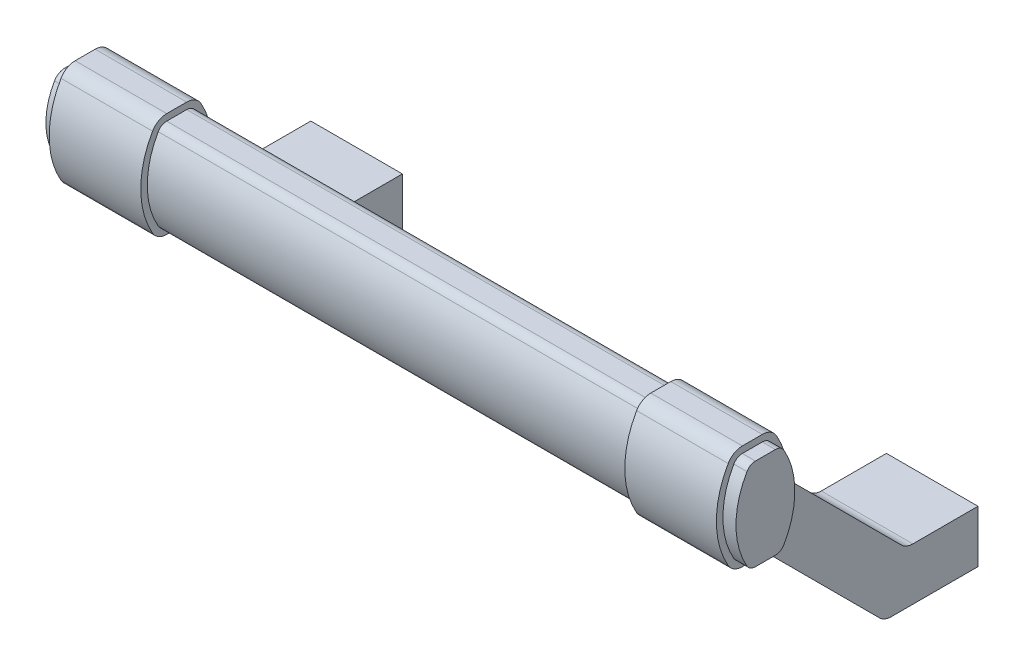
ISO-10303-21;
HEADER;
FILE_DESCRIPTION(('STEP AP214'),'2;1');
FILE_NAME('part.step','',(''),(''),'','','');
FILE_SCHEMA(('AUTOMOTIVE_DESIGN { 1 0 10303 214 1 1 1 1 }'));
ENDSEC;
DATA;
#1=APPLICATION_CONTEXT('core data for automotive mechanical design processes');
#2=APPLICATION_PROTOCOL_DEFINITION('international standard','automotive_design',2000,#1);
#3=PRODUCT_CONTEXT('',#1,'mechanical');
#4=PRODUCT('Part','Part','',(#3));
#5=PRODUCT_RELATED_PRODUCT_CATEGORY('part','',(#4));
#6=PRODUCT_DEFINITION_FORMATION('','',#4);
#7=PRODUCT_DEFINITION_CONTEXT('part definition',#1,'design');
#8=PRODUCT_DEFINITION('design','',#6,#7);
#9=PRODUCT_DEFINITION_SHAPE('','',#8);
#10=(LENGTH_UNIT() NAMED_UNIT(*) SI_UNIT(.MILLI.,.METRE.));
#11=(NAMED_UNIT(*) PLANE_ANGLE_UNIT() SI_UNIT($,.RADIAN.));
#12=(NAMED_UNIT(*) SI_UNIT($,.STERADIAN.) SOLID_ANGLE_UNIT());
#13=UNCERTAINTY_MEASURE_WITH_UNIT(LENGTH_MEASURE(1.E-05),#10,'distance_accuracy_value','');
#14=(GEOMETRIC_REPRESENTATION_CONTEXT(3) GLOBAL_UNCERTAINTY_ASSIGNED_CONTEXT((#13)) GLOBAL_UNIT_ASSIGNED_CONTEXT((#10,
#11,#12)) REPRESENTATION_CONTEXT('',''));
#15=CARTESIAN_POINT('',(0.,0.,0.));
#16=DIRECTION('',(0.,0.,1.));
#17=DIRECTION('',(1.,0.,0.));
#18=AXIS2_PLACEMENT_3D('',#15,#16,#17);
#19=CARTESIAN_POINT('',(113.,22.,42.5));
#20=DIRECTION('',(-1.,0.,0.));
#21=DIRECTION('',(0.,-1.,0.));
#22=AXIS2_PLACEMENT_3D('',#19,#20,#21);
#23=CYLINDRICAL_SURFACE('',#22,12.5);
#24=DIRECTION('',(-1.,0.,0.));
#25=VECTOR('',#24,1.);
#26=CARTESIAN_POINT('',(113.,28.25,31.6746824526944));
#27=LINE('',#26,#25);
#28=CARTESIAN_POINT('',(97.,28.25,31.6746824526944));
#29=VERTEX_POINT('',#28);
#30=CARTESIAN_POINT('',(95.,28.25,31.6746824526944));
#31=VERTEX_POINT('',#30);
#32=EDGE_CURVE('E605',#29,#31,#27,.T.);
#33=ORIENTED_EDGE('',*,*,#32,.F.);
#34=CARTESIAN_POINT('',(97.,22.,42.5));
#35=DIRECTION('',(1.,0.,0.));
#36=DIRECTION('',(0.,0.,-1.));
#37=AXIS2_PLACEMENT_3D('',#34,#35,#36);
#38=CIRCLE('',#37,12.5);
#39=CARTESIAN_POINT('',(97.,15.75,31.6746824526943));
#40=VERTEX_POINT('',#39);
#41=EDGE_CURVE('E29',#29,#40,#38,.F.);
#42=ORIENTED_EDGE('',*,*,#41,.T.);
#43=DIRECTION('',(-1.,0.,0.));
#44=VECTOR('',#43,1.);
#45=CARTESIAN_POINT('',(113.,15.75,31.6746824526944));
#46=LINE('',#45,#44);
#47=CARTESIAN_POINT('',(95.,15.75,31.6746824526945));
#48=VERTEX_POINT('',#47);
#49=EDGE_CURVE('E604',#40,#48,#46,.T.);
#50=ORIENTED_EDGE('',*,*,#49,.T.);
#51=CARTESIAN_POINT('',(95.,22.,42.5));
#52=DIRECTION('',(1.,0.,0.));
#53=DIRECTION('',(0.,0.,-1.));
#54=AXIS2_PLACEMENT_3D('',#51,#52,#53);
#55=CIRCLE('',#54,12.5);
#56=EDGE_CURVE('E583',#31,#48,#55,.F.);
#57=ORIENTED_EDGE('',*,*,#56,.F.);
#58=EDGE_LOOP('',(#33,#42,#50,#57));
#59=FACE_BOUND('',#58,.T.);
#60=ADVANCED_FACE('F14',(#59),#23,.T.);
#61=CARTESIAN_POINT('',(113.,16.5,32.973720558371));
#62=DIRECTION('',(-1.,0.,0.));
#63=DIRECTION('',(0.,-1.,0.));
#64=AXIS2_PLACEMENT_3D('',#61,#62,#63);
#65=CYLINDRICAL_SURFACE('',#64,1.5);
#66=ORIENTED_EDGE('',*,*,#49,.F.);
#67=CARTESIAN_POINT('',(97.,16.5,32.973720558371));
#68=DIRECTION('',(1.,0.,0.));
#69=DIRECTION('',(0.,0.,-1.));
#70=AXIS2_PLACEMENT_3D('',#67,#68,#69);
#71=CIRCLE('',#70,1.5);
#72=CARTESIAN_POINT('',(97.,15.,32.973720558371));
#73=VERTEX_POINT('',#72);
#74=EDGE_CURVE('E834',#40,#73,#71,.F.);
#75=ORIENTED_EDGE('',*,*,#74,.T.);
#76=DIRECTION('',(-1.,0.,0.));
#77=VECTOR('',#76,1.);
#78=CARTESIAN_POINT('',(113.,15.,32.973720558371));
#79=LINE('',#78,#77);
#80=CARTESIAN_POINT('',(95.,15.,32.973720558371));
#81=VERTEX_POINT('',#80);
#82=EDGE_CURVE('E611',#73,#81,#79,.T.);
#83=ORIENTED_EDGE('',*,*,#82,.T.);
#84=CARTESIAN_POINT('',(95.,16.5,32.973720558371));
#85=DIRECTION('',(1.,0.,0.));
#86=DIRECTION('',(0.,0.,-1.));
#87=AXIS2_PLACEMENT_3D('',#84,#85,#86);
#88=CIRCLE('',#87,1.5);
#89=EDGE_CURVE('E696',#48,#81,#88,.F.);
#90=ORIENTED_EDGE('',*,*,#89,.F.);
#91=EDGE_LOOP('',(#66,#75,#83,#90));
#92=FACE_BOUND('',#91,.T.);
#93=ADVANCED_FACE('F865',(#92),#65,.T.);
#94=CARTESIAN_POINT('',(113.,15.,32.973720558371));
#95=DIRECTION('',(0.,-1.,0.));
#96=DIRECTION('',(1.,0.,0.));
#97=AXIS2_PLACEMENT_3D('',#94,#95,#96);
#98=PLANE('',#97);
#99=ORIENTED_EDGE('',*,*,#82,.F.);
#100=DIRECTION('',(0.,0.,1.));
#101=VECTOR('',#100,1.);
#102=CARTESIAN_POINT('',(97.,15.,32.973720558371));
#103=LINE('',#102,#101);
#104=CARTESIAN_POINT('',(97.,15.,36.0262794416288));
#105=VERTEX_POINT('',#104);
#106=EDGE_CURVE('E837',#73,#105,#103,.T.);
#107=ORIENTED_EDGE('',*,*,#106,.T.);
#108=DIRECTION('',(-1.,0.,0.));
#109=VECTOR('',#108,1.);
#110=CARTESIAN_POINT('',(113.,15.,36.0262794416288));
#111=LINE('',#110,#109);
#112=CARTESIAN_POINT('',(95.,15.,36.0262794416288));
#113=VERTEX_POINT('',#112);
#114=EDGE_CURVE('E614',#105,#113,#111,.T.);
#115=ORIENTED_EDGE('',*,*,#114,.T.);
#116=DIRECTION('',(0.,0.,1.));
#117=VECTOR('',#116,1.);
#118=CARTESIAN_POINT('',(95.,15.,32.973720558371));
#119=LINE('',#118,#117);
#120=EDGE_CURVE('E693',#81,#113,#119,.T.);
#121=ORIENTED_EDGE('',*,*,#120,.F.);
#122=EDGE_LOOP('',(#99,#107,#115,#121));
#123=FACE_BOUND('',#122,.T.);
#124=ADVANCED_FACE('F861',(#123),#98,.T.);
#125=CARTESIAN_POINT('',(113.,16.5,36.0262794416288));
#126=DIRECTION('',(-1.,0.,0.));
#127=DIRECTION('',(0.,-1.,0.));
#128=AXIS2_PLACEMENT_3D('',#125,#126,#127);
#129=CYLINDRICAL_SURFACE('',#128,1.49999999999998);
#130=CARTESIAN_POINT('',(97.,16.5,36.0262794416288));
#131=DIRECTION('',(1.,0.,0.));
#132=DIRECTION('',(0.,0.,-1.));
#133=AXIS2_PLACEMENT_3D('',#130,#131,#132);
#134=CIRCLE('',#133,1.49999999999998);
#135=CARTESIAN_POINT('',(97.,15.75,37.3253175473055));
#136=VERTEX_POINT('',#135);
#137=EDGE_CURVE('E840',#136,#105,#134,.T.);
#138=ORIENTED_EDGE('',*,*,#137,.F.);
#139=DIRECTION('',(-1.,0.,0.));
#140=VECTOR('',#139,1.);
#141=CARTESIAN_POINT('',(113.,15.75,37.3253175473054));
#142=LINE('',#141,#140);
#143=CARTESIAN_POINT('',(95.,15.75,37.3253175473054));
#144=VERTEX_POINT('',#143);
#145=EDGE_CURVE('E617',#136,#144,#142,.T.);
#146=ORIENTED_EDGE('',*,*,#145,.T.);
#147=CARTESIAN_POINT('',(95.,16.5,36.0262794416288));
#148=DIRECTION('',(1.,0.,0.));
#149=DIRECTION('',(0.,0.,-1.));
#150=AXIS2_PLACEMENT_3D('',#147,#148,#149);
#151=CIRCLE('',#150,1.49999999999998);
#152=EDGE_CURVE('E690',#144,#113,#151,.T.);
#153=ORIENTED_EDGE('',*,*,#152,.T.);
#154=ORIENTED_EDGE('',*,*,#114,.F.);
#155=EDGE_LOOP('',(#138,#146,#153,#154));
#156=FACE_BOUND('',#155,.T.);
#157=ADVANCED_FACE('F858',(#156),#129,.T.);
#158=CARTESIAN_POINT('',(113.,22.,26.5));
#159=DIRECTION('',(-1.,0.,0.));
#160=DIRECTION('',(0.,-1.,0.));
#161=AXIS2_PLACEMENT_3D('',#158,#159,#160);
#162=CYLINDRICAL_SURFACE('',#161,12.5);
#163=CARTESIAN_POINT('',(97.,22.,26.5));
#164=DIRECTION('',(1.,0.,0.));
#165=DIRECTION('',(0.,0.,-1.));
#166=AXIS2_PLACEMENT_3D('',#163,#164,#165);
#167=CIRCLE('',#166,12.5);
#168=CARTESIAN_POINT('',(97.,28.25,37.3253175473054));
#169=VERTEX_POINT('',#168);
#170=EDGE_CURVE('E842',#169,#136,#167,.T.);
#171=ORIENTED_EDGE('',*,*,#170,.F.);
#172=DIRECTION('',(-1.,0.,0.));
#173=VECTOR('',#172,1.);
#174=CARTESIAN_POINT('',(113.,28.25,37.3253175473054));
#175=LINE('',#174,#173);
#176=CARTESIAN_POINT('',(95.,28.25,37.3253175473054));
#177=VERTEX_POINT('',#176);
#178=EDGE_CURVE('E619',#169,#177,#175,.T.);
#179=ORIENTED_EDGE('',*,*,#178,.T.);
#180=CARTESIAN_POINT('',(95.,22.,26.5));
#181=DIRECTION('',(1.,0.,0.));
#182=DIRECTION('',(0.,0.,-1.));
#183=AXIS2_PLACEMENT_3D('',#180,#181,#182);
#184=CIRCLE('',#183,12.5);
#185=EDGE_CURVE('E688',#177,#144,#184,.T.);
#186=ORIENTED_EDGE('',*,*,#185,.T.);
#187=ORIENTED_EDGE('',*,*,#145,.F.);
#188=EDGE_LOOP('',(#171,#179,#186,#187));
#189=FACE_BOUND('',#188,.T.);
#190=ADVANCED_FACE('F847',(#189),#162,.T.);
#191=CARTESIAN_POINT('',(113.,27.5,36.0262794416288));
#192=DIRECTION('',(-1.,0.,0.));
#193=DIRECTION('',(0.,-1.,0.));
#194=AXIS2_PLACEMENT_3D('',#191,#192,#193);
#195=CYLINDRICAL_SURFACE('',#194,1.5);
#196=CARTESIAN_POINT('',(97.,27.5,36.0262794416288));
#197=DIRECTION('',(1.,0.,0.));
#198=DIRECTION('',(0.,0.,-1.));
#199=AXIS2_PLACEMENT_3D('',#196,#197,#198);
#200=CIRCLE('',#199,1.5);
#201=CARTESIAN_POINT('',(97.,29.,36.0262794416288));
#202=VERTEX_POINT('',#201);
#203=EDGE_CURVE('E373',#202,#169,#200,.T.);
#204=ORIENTED_EDGE('',*,*,#203,.F.);
#205=DIRECTION('',(-1.,0.,0.));
#206=VECTOR('',#205,1.);
#207=CARTESIAN_POINT('',(113.,29.,36.0262794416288));
#208=LINE('',#207,#206);
#209=CARTESIAN_POINT('',(95.,29.,36.0262794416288));
#210=VERTEX_POINT('',#209);
#211=EDGE_CURVE('E372',#202,#210,#208,.T.);
#212=ORIENTED_EDGE('',*,*,#211,.T.);
#213=CARTESIAN_POINT('',(95.,27.5,36.0262794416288));
#214=DIRECTION('',(1.,0.,0.));
#215=DIRECTION('',(0.,0.,-1.));
#216=AXIS2_PLACEMENT_3D('',#213,#214,#215);
#217=CIRCLE('',#216,1.5);
#218=EDGE_CURVE('E686',#210,#177,#217,.T.);
#219=ORIENTED_EDGE('',*,*,#218,.T.);
#220=ORIENTED_EDGE('',*,*,#178,.F.);
#221=EDGE_LOOP('',(#204,#212,#219,#220));
#222=FACE_BOUND('',#221,.T.);
#223=ADVANCED_FACE('F848',(#222),#195,.T.);
#224=CARTESIAN_POINT('',(113.,29.,32.9737205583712));
#225=DIRECTION('',(0.,-1.,0.));
#226=DIRECTION('',(1.,0.,0.));
#227=AXIS2_PLACEMENT_3D('',#224,#225,#226);
#228=PLANE('',#227);
#229=DIRECTION('',(0.,0.,1.));
#230=VECTOR('',#229,1.);
#231=CARTESIAN_POINT('',(97.,29.,32.9737205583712));
#232=LINE('',#231,#230);
#233=CARTESIAN_POINT('',(97.,29.,32.9737205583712));
#234=VERTEX_POINT('',#233);
#235=EDGE_CURVE('E366',#234,#202,#232,.T.);
#236=ORIENTED_EDGE('',*,*,#235,.F.);
#237=DIRECTION('',(-1.,0.,0.));
#238=VECTOR('',#237,1.);
#239=CARTESIAN_POINT('',(113.,29.,32.9737205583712));
#240=LINE('',#239,#238);
#241=CARTESIAN_POINT('',(95.,29.,32.9737205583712));
#242=VERTEX_POINT('',#241);
#243=EDGE_CURVE('E36',#234,#242,#240,.T.);
#244=ORIENTED_EDGE('',*,*,#243,.T.);
#245=DIRECTION('',(0.,0.,1.));
#246=VECTOR('',#245,1.);
#247=CARTESIAN_POINT('',(95.,29.,32.9737205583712));
#248=LINE('',#247,#246);
#249=EDGE_CURVE('E684',#242,#210,#248,.T.);
#250=ORIENTED_EDGE('',*,*,#249,.T.);
#251=ORIENTED_EDGE('',*,*,#211,.F.);
#252=EDGE_LOOP('',(#236,#244,#250,#251));
#253=FACE_BOUND('',#252,.T.);
#254=ADVANCED_FACE('F371',(#253),#228,.F.);
#255=CARTESIAN_POINT('',(113.,27.5,32.973720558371));
#256=DIRECTION('',(-1.,0.,0.));
#257=DIRECTION('',(0.,-1.,0.));
#258=AXIS2_PLACEMENT_3D('',#255,#256,#257);
#259=CYLINDRICAL_SURFACE('',#258,1.49999999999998);
#260=ORIENTED_EDGE('',*,*,#243,.F.);
#261=CARTESIAN_POINT('',(97.,27.5,32.973720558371));
#262=DIRECTION('',(1.,0.,0.));
#263=DIRECTION('',(0.,0.,-1.));
#264=AXIS2_PLACEMENT_3D('',#261,#262,#263);
#265=CIRCLE('',#264,1.49999999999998);
#266=EDGE_CURVE('E9',#234,#29,#265,.F.);
#267=ORIENTED_EDGE('',*,*,#266,.T.);
#268=ORIENTED_EDGE('',*,*,#32,.T.);
#269=CARTESIAN_POINT('',(95.,27.5,32.973720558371));
#270=DIRECTION('',(1.,0.,0.));
#271=DIRECTION('',(0.,0.,-1.));
#272=AXIS2_PLACEMENT_3D('',#269,#270,#271);
#273=CIRCLE('',#272,1.49999999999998);
#274=EDGE_CURVE('E377',#242,#31,#273,.F.);
#275=ORIENTED_EDGE('',*,*,#274,.F.);
#276=EDGE_LOOP('',(#260,#267,#268,#275));
#277=FACE_BOUND('',#276,.T.);
#278=ADVANCED_FACE('F375',(#277),#259,.T.);
#279=CARTESIAN_POINT('',(81.,29.,32.9737205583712));
#280=VERTEX_POINT('',#279);
#281=CARTESIAN_POINT('',(7.,29.,32.9737205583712));
#282=VERTEX_POINT('',#281);
#283=EDGE_CURVE('E380',#280,#282,#240,.T.);
#284=ORIENTED_EDGE('',*,*,#283,.F.);
#285=CARTESIAN_POINT('',(81.,27.5,32.973720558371));
#286=DIRECTION('',(1.,0.,0.));
#287=DIRECTION('',(0.,0.,-1.));
#288=AXIS2_PLACEMENT_3D('',#285,#286,#287);
#289=CIRCLE('',#288,1.49999999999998);
#290=CARTESIAN_POINT('',(81.,28.25,31.6746824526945));
#291=VERTEX_POINT('',#290);
#292=EDGE_CURVE('E670',#280,#291,#289,.F.);
#293=ORIENTED_EDGE('',*,*,#292,.T.);
#294=CARTESIAN_POINT('',(7.,28.25,31.6746824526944));
#295=VERTEX_POINT('',#294);
#296=EDGE_CURVE('E593',#291,#295,#27,.T.);
#297=ORIENTED_EDGE('',*,*,#296,.T.);
#298=CARTESIAN_POINT('',(7.,27.5,32.973720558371));
#299=DIRECTION('',(-1.,0.,0.));
#300=DIRECTION('',(0.,-1.,0.));
#301=AXIS2_PLACEMENT_3D('',#298,#299,#300);
#302=CIRCLE('',#301,1.49999999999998);
#303=EDGE_CURVE('E661',#282,#295,#302,.T.);
#304=ORIENTED_EDGE('',*,*,#303,.F.);
#305=EDGE_LOOP('',(#284,#293,#297,#304));
#306=FACE_BOUND('',#305,.T.);
#307=ADVANCED_FACE('F1094',(#306),#259,.T.);
#308=DIRECTION('',(0.,0.,1.));
#309=VECTOR('',#308,1.);
#310=CARTESIAN_POINT('',(81.,29.,32.9737205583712));
#311=LINE('',#310,#309);
#312=CARTESIAN_POINT('',(81.,29.,36.0262794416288));
#313=VERTEX_POINT('',#312);
#314=EDGE_CURVE('E672',#280,#313,#311,.T.);
#315=ORIENTED_EDGE('',*,*,#314,.F.);
#316=ORIENTED_EDGE('',*,*,#283,.T.);
#317=DIRECTION('',(0.,0.,1.));
#318=VECTOR('',#317,1.);
#319=CARTESIAN_POINT('',(7.,29.,32.9737205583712));
#320=LINE('',#319,#318);
#321=CARTESIAN_POINT('',(7.,29.,36.0262794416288));
#322=VERTEX_POINT('',#321);
#323=EDGE_CURVE('E652',#282,#322,#320,.T.);
#324=ORIENTED_EDGE('',*,*,#323,.T.);
#325=EDGE_CURVE('E620',#313,#322,#208,.T.);
#326=ORIENTED_EDGE('',*,*,#325,.F.);
#327=EDGE_LOOP('',(#315,#316,#324,#326));
#328=FACE_BOUND('',#327,.T.);
#329=ADVANCED_FACE('F901',(#328),#228,.F.);
#330=CARTESIAN_POINT('',(81.,27.5,36.0262794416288));
#331=DIRECTION('',(1.,0.,0.));
#332=DIRECTION('',(0.,0.,-1.));
#333=AXIS2_PLACEMENT_3D('',#330,#331,#332);
#334=CIRCLE('',#333,1.5);
#335=CARTESIAN_POINT('',(81.,28.25,37.3253175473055));
#336=VERTEX_POINT('',#335);
#337=EDGE_CURVE('E674',#313,#336,#334,.T.);
#338=ORIENTED_EDGE('',*,*,#337,.F.);
#339=ORIENTED_EDGE('',*,*,#325,.T.);
#340=CARTESIAN_POINT('',(7.,27.5,36.0262794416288));
#341=DIRECTION('',(1.,0.,0.));
#342=DIRECTION('',(0.,1.,0.));
#343=AXIS2_PLACEMENT_3D('',#340,#341,#342);
#344=CIRCLE('',#343,1.5);
#345=CARTESIAN_POINT('',(7.,28.25,37.3253175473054));
#346=VERTEX_POINT('',#345);
#347=EDGE_CURVE('E644',#322,#346,#344,.T.);
#348=ORIENTED_EDGE('',*,*,#347,.T.);
#349=EDGE_CURVE('E618',#336,#346,#175,.T.);
#350=ORIENTED_EDGE('',*,*,#349,.F.);
#351=EDGE_LOOP('',(#338,#339,#348,#350));
#352=FACE_BOUND('',#351,.T.);
#353=ADVANCED_FACE('F650',(#352),#195,.T.);
#354=CARTESIAN_POINT('',(81.,22.,26.5));
#355=DIRECTION('',(1.,0.,0.));
#356=DIRECTION('',(0.,0.,-1.));
#357=AXIS2_PLACEMENT_3D('',#354,#355,#356);
#358=CIRCLE('',#357,12.5);
#359=CARTESIAN_POINT('',(81.,15.75,37.3253175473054));
#360=VERTEX_POINT('',#359);
#361=EDGE_CURVE('E634',#336,#360,#358,.T.);
#362=ORIENTED_EDGE('',*,*,#361,.F.);
#363=ORIENTED_EDGE('',*,*,#349,.T.);
#364=CARTESIAN_POINT('',(7.,22.,26.5));
#365=DIRECTION('',(1.,0.,0.));
#366=DIRECTION('',(0.,1.,0.));
#367=AXIS2_PLACEMENT_3D('',#364,#365,#366);
#368=CIRCLE('',#367,12.5);
#369=CARTESIAN_POINT('',(7.,15.75,37.3253175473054));
#370=VERTEX_POINT('',#369);
#371=EDGE_CURVE('E633',#346,#370,#368,.T.);
#372=ORIENTED_EDGE('',*,*,#371,.T.);
#373=EDGE_CURVE('E616',#360,#370,#142,.T.);
#374=ORIENTED_EDGE('',*,*,#373,.F.);
#375=EDGE_LOOP('',(#362,#363,#372,#374));
#376=FACE_BOUND('',#375,.T.);
#377=ADVANCED_FACE('F631',(#376),#162,.T.);
#378=CARTESIAN_POINT('',(81.,16.5,36.0262794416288));
#379=DIRECTION('',(1.,0.,0.));
#380=DIRECTION('',(0.,0.,-1.));
#381=AXIS2_PLACEMENT_3D('',#378,#379,#380);
#382=CIRCLE('',#381,1.49999999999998);
#383=CARTESIAN_POINT('',(81.,15.,36.0262794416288));
#384=VERTEX_POINT('',#383);
#385=EDGE_CURVE('E677',#360,#384,#382,.T.);
#386=ORIENTED_EDGE('',*,*,#385,.F.);
#387=ORIENTED_EDGE('',*,*,#373,.T.);
#388=CARTESIAN_POINT('',(7.,16.5,36.0262794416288));
#389=DIRECTION('',(1.,0.,0.));
#390=DIRECTION('',(0.,1.,0.));
#391=AXIS2_PLACEMENT_3D('',#388,#389,#390);
#392=CIRCLE('',#391,1.49999999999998);
#393=CARTESIAN_POINT('',(7.,15.,36.0262794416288));
#394=VERTEX_POINT('',#393);
#395=EDGE_CURVE('E648',#370,#394,#392,.T.);
#396=ORIENTED_EDGE('',*,*,#395,.T.);
#397=EDGE_CURVE('E613',#384,#394,#111,.T.);
#398=ORIENTED_EDGE('',*,*,#397,.F.);
#399=EDGE_LOOP('',(#386,#387,#396,#398));
#400=FACE_BOUND('',#399,.T.);
#401=ADVANCED_FACE('F888',(#400),#129,.T.);
#402=CARTESIAN_POINT('',(81.,15.,32.973720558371));
#403=VERTEX_POINT('',#402);
#404=CARTESIAN_POINT('',(7.,15.,32.973720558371));
#405=VERTEX_POINT('',#404);
#406=EDGE_CURVE('E607',#403,#405,#79,.T.);
#407=ORIENTED_EDGE('',*,*,#406,.F.);
#408=DIRECTION('',(0.,0.,1.));
#409=VECTOR('',#408,1.);
#410=CARTESIAN_POINT('',(81.,15.,32.973720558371));
#411=LINE('',#410,#409);
#412=EDGE_CURVE('E679',#403,#384,#411,.T.);
#413=ORIENTED_EDGE('',*,*,#412,.T.);
#414=ORIENTED_EDGE('',*,*,#397,.T.);
#415=DIRECTION('',(0.,0.,1.));
#416=VECTOR('',#415,1.);
#417=CARTESIAN_POINT('',(7.,15.,32.973720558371));
#418=LINE('',#417,#416);
#419=EDGE_CURVE('E656',#405,#394,#418,.T.);
#420=ORIENTED_EDGE('',*,*,#419,.F.);
#421=EDGE_LOOP('',(#407,#413,#414,#420));
#422=FACE_BOUND('',#421,.T.);
#423=ADVANCED_FACE('F884',(#422),#98,.T.);
#424=CARTESIAN_POINT('',(81.,15.75,31.6746824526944));
#425=VERTEX_POINT('',#424);
#426=CARTESIAN_POINT('',(7.,15.75,31.6746824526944));
#427=VERTEX_POINT('',#426);
#428=EDGE_CURVE('E591',#425,#427,#46,.T.);
#429=ORIENTED_EDGE('',*,*,#428,.F.);
#430=CARTESIAN_POINT('',(81.,16.5,32.973720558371));
#431=DIRECTION('',(1.,0.,0.));
#432=DIRECTION('',(0.,0.,-1.));
#433=AXIS2_PLACEMENT_3D('',#430,#431,#432);
#434=CIRCLE('',#433,1.5);
#435=EDGE_CURVE('E600',#425,#403,#434,.F.);
#436=ORIENTED_EDGE('',*,*,#435,.T.);
#437=ORIENTED_EDGE('',*,*,#406,.T.);
#438=CARTESIAN_POINT('',(7.,16.5,32.973720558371));
#439=DIRECTION('',(-1.,0.,0.));
#440=DIRECTION('',(0.,-1.,0.));
#441=AXIS2_PLACEMENT_3D('',#438,#439,#440);
#442=CIRCLE('',#441,1.5);
#443=EDGE_CURVE('E603',#427,#405,#442,.T.);
#444=ORIENTED_EDGE('',*,*,#443,.F.);
#445=EDGE_LOOP('',(#429,#436,#437,#444));
#446=FACE_BOUND('',#445,.T.);
#447=ADVANCED_FACE('F599',(#446),#65,.T.);
#448=ORIENTED_EDGE('',*,*,#296,.F.);
#449=CARTESIAN_POINT('',(81.,22.,42.5));
#450=DIRECTION('',(1.,0.,0.));
#451=DIRECTION('',(0.,0.,-1.));
#452=AXIS2_PLACEMENT_3D('',#449,#450,#451);
#453=CIRCLE('',#452,12.5);
#454=EDGE_CURVE('E22',#291,#425,#453,.F.);
#455=ORIENTED_EDGE('',*,*,#454,.T.);
#456=ORIENTED_EDGE('',*,*,#428,.T.);
#457=CARTESIAN_POINT('',(7.,22.,42.5));
#458=DIRECTION('',(-1.,0.,0.));
#459=DIRECTION('',(0.,-1.,0.));
#460=AXIS2_PLACEMENT_3D('',#457,#458,#459);
#461=CIRCLE('',#460,12.5);
#462=EDGE_CURVE('E659',#295,#427,#461,.T.);
#463=ORIENTED_EDGE('',*,*,#462,.F.);
#464=EDGE_LOOP('',(#448,#455,#456,#463));
#465=FACE_BOUND('',#464,.T.);
#466=ADVANCED_FACE('F589',(#465),#23,.T.);
#467=CARTESIAN_POINT('',(-7.,4.,0.));
#468=DIRECTION('',(0.,0.,1.));
#469=DIRECTION('',(-1.,0.,0.));
#470=AXIS2_PLACEMENT_3D('',#467,#468,#469);
#471=PLANE('',#470);
#472=CARTESIAN_POINT('',(0.,0.,0.));
#473=DIRECTION('',(0.,0.,-1.));
#474=DIRECTION('',(1.,0.,0.));
#475=AXIS2_PLACEMENT_3D('',#472,#473,#474);
#476=CIRCLE('',#475,2.5);
#477=CARTESIAN_POINT('',(2.5,0.,0.));
#478=VERTEX_POINT('',#477);
#479=EDGE_CURVE('E667',#478,#478,#476,.T.);
#480=ORIENTED_EDGE('',*,*,#479,.F.);
#481=EDGE_LOOP('',(#480));
#482=FACE_BOUND('',#481,.T.);
#483=DIRECTION('',(1.,0.,0.));
#484=VECTOR('',#483,1.);
#485=CARTESIAN_POINT('',(-7.,-4.,0.));
#486=LINE('',#485,#484);
#487=CARTESIAN_POINT('',(-7.,-4.,0.));
#488=VERTEX_POINT('',#487);
#489=CARTESIAN_POINT('',(7.,-4.,0.));
#490=VERTEX_POINT('',#489);
#491=EDGE_CURVE('E581',#488,#490,#486,.T.);
#492=ORIENTED_EDGE('',*,*,#491,.F.);
#493=DIRECTION('',(0.,-1.,0.));
#494=VECTOR('',#493,1.);
#495=CARTESIAN_POINT('',(-7.,4.,0.));
#496=LINE('',#495,#494);
#497=CARTESIAN_POINT('',(-7.,4.,0.));
#498=VERTEX_POINT('',#497);
#499=EDGE_CURVE('E503',#498,#488,#496,.T.);
#500=ORIENTED_EDGE('',*,*,#499,.F.);
#501=DIRECTION('',(1.,0.,0.));
#502=VECTOR('',#501,1.);
#503=CARTESIAN_POINT('',(-7.,4.,0.));
#504=LINE('',#503,#502);
#505=CARTESIAN_POINT('',(7.,4.,0.));
#506=VERTEX_POINT('',#505);
#507=EDGE_CURVE('E551',#498,#506,#504,.T.);
#508=ORIENTED_EDGE('',*,*,#507,.T.);
#509=DIRECTION('',(0.,-1.,0.));
#510=VECTOR('',#509,1.);
#511=CARTESIAN_POINT('',(7.,4.,0.));
#512=LINE('',#511,#510);
#513=EDGE_CURVE('E455',#506,#490,#512,.T.);
#514=ORIENTED_EDGE('',*,*,#513,.T.);
#515=EDGE_LOOP('',(#492,#500,#508,#514));
#516=FACE_BOUND('',#515,.T.);
#517=ADVANCED_FACE('F877',(#482,#516),#471,.F.);
#518=CARTESIAN_POINT('',(-7.,-4.,0.));
#519=DIRECTION('',(0.,1.,0.));
#520=DIRECTION('',(-1.,0.,0.));
#521=AXIS2_PLACEMENT_3D('',#518,#519,#520);
#522=PLANE('',#521);
#523=DIRECTION('',(1.,0.,0.));
#524=VECTOR('',#523,1.);
#525=CARTESIAN_POINT('',(-7.,-4.,13.278174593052));
#526=LINE('',#525,#524);
#527=CARTESIAN_POINT('',(-7.,-4.,13.278174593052));
#528=VERTEX_POINT('',#527);
#529=CARTESIAN_POINT('',(7.,-4.,13.278174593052));
#530=VERTEX_POINT('',#529);
#531=EDGE_CURVE('E579',#528,#530,#526,.T.);
#532=ORIENTED_EDGE('',*,*,#531,.F.);
#533=DIRECTION('',(0.,0.,1.));
#534=VECTOR('',#533,1.);
#535=CARTESIAN_POINT('',(-7.,-4.,0.));
#536=LINE('',#535,#534);
#537=EDGE_CURVE('E506',#488,#528,#536,.T.);
#538=ORIENTED_EDGE('',*,*,#537,.F.);
#539=ORIENTED_EDGE('',*,*,#491,.T.);
#540=DIRECTION('',(0.,0.,1.));
#541=VECTOR('',#540,1.);
#542=CARTESIAN_POINT('',(7.,-4.,0.));
#543=LINE('',#542,#541);
#544=EDGE_CURVE('E458',#490,#530,#543,.T.);
#545=ORIENTED_EDGE('',*,*,#544,.T.);
#546=EDGE_LOOP('',(#532,#538,#539,#545));
#547=FACE_BOUND('',#546,.T.);
#548=ADVANCED_FACE('F16',(#547),#522,.F.);
#549=CARTESIAN_POINT('',(-7.,-1.5,13.278174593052));
#550=DIRECTION('',(1.,0.,0.));
#551=DIRECTION('',(0.,1.,0.));
#552=AXIS2_PLACEMENT_3D('',#549,#550,#551);
#553=CYLINDRICAL_SURFACE('',#552,2.49999999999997);
#554=DIRECTION('',(1.,0.,0.));
#555=VECTOR('',#554,1.);
#556=CARTESIAN_POINT('',(-7.,-3.26776695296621,15.0459415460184));
#557=LINE('',#556,#555);
#558=CARTESIAN_POINT('',(-7.,-3.26776695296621,15.0459415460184));
#559=VERTEX_POINT('',#558);
#560=CARTESIAN_POINT('',(7.,-3.26776695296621,15.0459415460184));
#561=VERTEX_POINT('',#560);
#562=EDGE_CURVE('E577',#559,#561,#557,.T.);
#563=ORIENTED_EDGE('',*,*,#562,.F.);
#564=CARTESIAN_POINT('',(-7.,-1.5,13.278174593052));
#565=DIRECTION('',(-1.,0.,0.));
#566=DIRECTION('',(0.,-1.,0.));
#567=AXIS2_PLACEMENT_3D('',#564,#565,#566);
#568=CIRCLE('',#567,2.49999999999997);
#569=EDGE_CURVE('E509',#528,#559,#568,.T.);
#570=ORIENTED_EDGE('',*,*,#569,.F.);
#571=ORIENTED_EDGE('',*,*,#531,.T.);
#572=CARTESIAN_POINT('',(7.,-1.5,13.278174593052));
#573=DIRECTION('',(-1.,0.,0.));
#574=DIRECTION('',(0.,-1.,0.));
#575=AXIS2_PLACEMENT_3D('',#572,#573,#574);
#576=CIRCLE('',#575,2.49999999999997);
#577=EDGE_CURVE('E461',#530,#561,#576,.T.);
#578=ORIENTED_EDGE('',*,*,#577,.T.);
#579=EDGE_LOOP('',(#563,#570,#571,#578));
#580=FACE_BOUND('',#579,.T.);
#581=ADVANCED_FACE('F996',(#580),#553,.T.);
#582=CARTESIAN_POINT('',(-7.,13.2677669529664,31.581475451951));
#583=DIRECTION('',(0.,-0.707106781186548,0.707106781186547));
#584=DIRECTION('',(0.,0.707106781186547,0.707106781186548));
#585=AXIS2_PLACEMENT_3D('',#582,#583,#584);
#586=PLANE('',#585);
#587=DIRECTION('',(1.,0.,0.));
#588=VECTOR('',#587,1.);
#589=CARTESIAN_POINT('',(-7.,13.2677669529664,31.581475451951));
#590=LINE('',#589,#588);
#591=CARTESIAN_POINT('',(-7.,13.2677669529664,31.581475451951));
#592=VERTEX_POINT('',#591);
#593=CARTESIAN_POINT('',(7.,13.2677669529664,31.581475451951));
#594=VERTEX_POINT('',#593);
#595=EDGE_CURVE('E575',#592,#594,#590,.T.);
#596=ORIENTED_EDGE('',*,*,#595,.F.);
#597=DIRECTION('',(0.,-0.707106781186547,-0.707106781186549));
#598=VECTOR('',#597,1.);
#599=CARTESIAN_POINT('',(-7.,13.2677669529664,31.581475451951));
#600=LINE('',#599,#598);
#601=EDGE_CURVE('E512',#592,#559,#600,.T.);
#602=ORIENTED_EDGE('',*,*,#601,.T.);
#603=ORIENTED_EDGE('',*,*,#562,.T.);
#604=DIRECTION('',(0.,-0.707106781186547,-0.707106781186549));
#605=VECTOR('',#604,1.);
#606=CARTESIAN_POINT('',(7.,13.2677669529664,31.581475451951));
#607=LINE('',#606,#605);
#608=EDGE_CURVE('E464',#594,#561,#607,.T.);
#609=ORIENTED_EDGE('',*,*,#608,.F.);
#610=EDGE_LOOP('',(#596,#602,#603,#609));
#611=FACE_BOUND('',#610,.T.);
#612=ADVANCED_FACE('F993',(#611),#586,.T.);
#613=CARTESIAN_POINT('',(-7.,11.5,33.3492424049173));
#614=DIRECTION('',(1.,0.,0.));
#615=DIRECTION('',(0.,1.,0.));
#616=AXIS2_PLACEMENT_3D('',#613,#614,#615);
#617=CYLINDRICAL_SURFACE('',#616,2.5);
#618=DIRECTION('',(1.,0.,0.));
#619=VECTOR('',#618,1.);
#620=CARTESIAN_POINT('',(-7.,14.,33.3492424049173));
#621=LINE('',#620,#619);
#622=CARTESIAN_POINT('',(-7.,14.,33.3492424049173));
#623=VERTEX_POINT('',#622);
#624=CARTESIAN_POINT('',(7.,14.,33.3492424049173));
#625=VERTEX_POINT('',#624);
#626=EDGE_CURVE('E573',#623,#625,#621,.T.);
#627=ORIENTED_EDGE('',*,*,#626,.F.);
#628=CARTESIAN_POINT('',(-7.,11.5,33.3492424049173));
#629=DIRECTION('',(-1.,0.,0.));
#630=DIRECTION('',(0.,-1.,0.));
#631=AXIS2_PLACEMENT_3D('',#628,#629,#630);
#632=CIRCLE('',#631,2.5);
#633=EDGE_CURVE('E515',#623,#592,#632,.T.);
#634=ORIENTED_EDGE('',*,*,#633,.T.);
#635=ORIENTED_EDGE('',*,*,#595,.T.);
#636=CARTESIAN_POINT('',(7.,11.5,33.3492424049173));
#637=DIRECTION('',(-1.,0.,0.));
#638=DIRECTION('',(0.,-1.,0.));
#639=AXIS2_PLACEMENT_3D('',#636,#637,#638);
#640=CIRCLE('',#639,2.5);
#641=EDGE_CURVE('E467',#625,#594,#640,.T.);
#642=ORIENTED_EDGE('',*,*,#641,.F.);
#643=EDGE_LOOP('',(#627,#634,#635,#642));
#644=FACE_BOUND('',#643,.T.);
#645=ADVANCED_FACE('F989',(#644),#617,.F.);
#646=CARTESIAN_POINT('',(-7.,14.,33.3492424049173));
#647=DIRECTION('',(0.,1.,0.));
#648=DIRECTION('',(-1.,0.,0.));
#649=AXIS2_PLACEMENT_3D('',#646,#647,#648);
#650=PLANE('',#649);
#651=DIRECTION('',(1.,0.,0.));
#652=VECTOR('',#651,1.);
#653=CARTESIAN_POINT('',(-7.,14.,36.0262794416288));
#654=LINE('',#653,#652);
#655=CARTESIAN_POINT('',(-7.,14.,36.0262794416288));
#656=VERTEX_POINT('',#655);
#657=CARTESIAN_POINT('',(7.,14.,36.0262794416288));
#658=VERTEX_POINT('',#657);
#659=EDGE_CURVE('E571',#656,#658,#654,.T.);
#660=ORIENTED_EDGE('',*,*,#659,.F.);
#661=DIRECTION('',(0.,0.,1.));
#662=VECTOR('',#661,1.);
#663=CARTESIAN_POINT('',(-7.,14.,33.3492424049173));
#664=LINE('',#663,#662);
#665=EDGE_CURVE('E518',#623,#656,#664,.T.);
#666=ORIENTED_EDGE('',*,*,#665,.F.);
#667=ORIENTED_EDGE('',*,*,#626,.T.);
#668=DIRECTION('',(0.,0.,1.));
#669=VECTOR('',#668,1.);
#670=CARTESIAN_POINT('',(7.,14.,33.3492424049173));
#671=LINE('',#670,#669);
#672=EDGE_CURVE('E470',#625,#658,#671,.T.);
#673=ORIENTED_EDGE('',*,*,#672,.T.);
#674=EDGE_LOOP('',(#660,#666,#667,#673));
#675=FACE_BOUND('',#674,.T.);
#676=ADVANCED_FACE('F985',(#675),#650,.F.);
#677=CARTESIAN_POINT('',(-7.,16.5,36.0262794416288));
#678=DIRECTION('',(1.,0.,0.));
#679=DIRECTION('',(0.,1.,0.));
#680=AXIS2_PLACEMENT_3D('',#677,#678,#679);
#681=CYLINDRICAL_SURFACE('',#680,2.5);
#682=DIRECTION('',(1.,0.,0.));
#683=VECTOR('',#682,1.);
#684=CARTESIAN_POINT('',(-7.,15.25,38.1913429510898));
#685=LINE('',#684,#683);
#686=CARTESIAN_POINT('',(-7.,15.25,38.1913429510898));
#687=VERTEX_POINT('',#686);
#688=CARTESIAN_POINT('',(7.,15.25,38.1913429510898));
#689=VERTEX_POINT('',#688);
#690=EDGE_CURVE('E569',#687,#689,#685,.T.);
#691=ORIENTED_EDGE('',*,*,#690,.F.);
#692=CARTESIAN_POINT('',(-7.,16.5,36.0262794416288));
#693=DIRECTION('',(-1.,0.,0.));
#694=DIRECTION('',(0.,-1.,0.));
#695=AXIS2_PLACEMENT_3D('',#692,#693,#694);
#696=CIRCLE('',#695,2.5);
#697=EDGE_CURVE('E521',#656,#687,#696,.T.);
#698=ORIENTED_EDGE('',*,*,#697,.F.);
#699=ORIENTED_EDGE('',*,*,#659,.T.);
#700=CARTESIAN_POINT('',(7.,16.5,36.0262794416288));
#701=DIRECTION('',(-1.,0.,0.));
#702=DIRECTION('',(0.,-1.,0.));
#703=AXIS2_PLACEMENT_3D('',#700,#701,#702);
#704=CIRCLE('',#703,2.5);
#705=EDGE_CURVE('E473',#658,#689,#704,.T.);
#706=ORIENTED_EDGE('',*,*,#705,.T.);
#707=EDGE_LOOP('',(#691,#698,#699,#706));
#708=FACE_BOUND('',#707,.T.);
#709=ADVANCED_FACE('F981',(#708),#681,.T.);
#710=CARTESIAN_POINT('',(-7.,22.,26.5));
#711=DIRECTION('',(1.,0.,0.));
#712=DIRECTION('',(0.,1.,0.));
#713=AXIS2_PLACEMENT_3D('',#710,#711,#712);
#714=CYLINDRICAL_SURFACE('',#713,13.5);
#715=DIRECTION('',(1.,0.,0.));
#716=VECTOR('',#715,1.);
#717=CARTESIAN_POINT('',(-7.,28.75,38.1913429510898));
#718=LINE('',#717,#716);
#719=CARTESIAN_POINT('',(-7.,28.75,38.1913429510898));
#720=VERTEX_POINT('',#719);
#721=CARTESIAN_POINT('',(7.,28.75,38.1913429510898));
#722=VERTEX_POINT('',#721);
#723=EDGE_CURVE('E567',#720,#722,#718,.T.);
#724=ORIENTED_EDGE('',*,*,#723,.F.);
#725=CARTESIAN_POINT('',(-7.,22.,26.5));
#726=DIRECTION('',(-1.,0.,0.));
#727=DIRECTION('',(0.,-1.,0.));
#728=AXIS2_PLACEMENT_3D('',#725,#726,#727);
#729=CIRCLE('',#728,13.5);
#730=EDGE_CURVE('E524',#687,#720,#729,.T.);
#731=ORIENTED_EDGE('',*,*,#730,.F.);
#732=ORIENTED_EDGE('',*,*,#690,.T.);
#733=CARTESIAN_POINT('',(7.,22.,26.5));
#734=DIRECTION('',(-1.,0.,0.));
#735=DIRECTION('',(0.,-1.,0.));
#736=AXIS2_PLACEMENT_3D('',#733,#734,#735);
#737=CIRCLE('',#736,13.5);
#738=EDGE_CURVE('E476',#689,#722,#737,.T.);
#739=ORIENTED_EDGE('',*,*,#738,.T.);
#740=EDGE_LOOP('',(#724,#731,#732,#739));
#741=FACE_BOUND('',#740,.T.);
#742=ADVANCED_FACE('F977',(#741),#714,.T.);
#743=CARTESIAN_POINT('',(-7.,27.5,36.0262794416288));
#744=DIRECTION('',(1.,0.,0.));
#745=DIRECTION('',(0.,1.,0.));
#746=AXIS2_PLACEMENT_3D('',#743,#744,#745);
#747=CYLINDRICAL_SURFACE('',#746,2.5);
#748=DIRECTION('',(1.,0.,0.));
#749=VECTOR('',#748,1.);
#750=CARTESIAN_POINT('',(-7.,30.,36.0262794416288));
#751=LINE('',#750,#749);
#752=CARTESIAN_POINT('',(-7.,30.,36.0262794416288));
#753=VERTEX_POINT('',#752);
#754=CARTESIAN_POINT('',(7.,30.,36.0262794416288));
#755=VERTEX_POINT('',#754);
#756=EDGE_CURVE('E565',#753,#755,#751,.T.);
#757=ORIENTED_EDGE('',*,*,#756,.F.);
#758=CARTESIAN_POINT('',(-7.,27.5,36.0262794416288));
#759=DIRECTION('',(-1.,0.,0.));
#760=DIRECTION('',(0.,-1.,0.));
#761=AXIS2_PLACEMENT_3D('',#758,#759,#760);
#762=CIRCLE('',#761,2.5);
#763=EDGE_CURVE('E527',#720,#753,#762,.T.);
#764=ORIENTED_EDGE('',*,*,#763,.F.);
#765=ORIENTED_EDGE('',*,*,#723,.T.);
#766=CARTESIAN_POINT('',(7.,27.5,36.0262794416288));
#767=DIRECTION('',(-1.,0.,0.));
#768=DIRECTION('',(0.,-1.,0.));
#769=AXIS2_PLACEMENT_3D('',#766,#767,#768);
#770=CIRCLE('',#769,2.5);
#771=EDGE_CURVE('E479',#722,#755,#770,.T.);
#772=ORIENTED_EDGE('',*,*,#771,.T.);
#773=EDGE_LOOP('',(#757,#764,#765,#772));
#774=FACE_BOUND('',#773,.T.);
#775=ADVANCED_FACE('F973',(#774),#747,.T.);
#776=CARTESIAN_POINT('',(-7.,30.,32.9737205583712));
#777=DIRECTION('',(0.,1.,0.));
#778=DIRECTION('',(-1.,0.,0.));
#779=AXIS2_PLACEMENT_3D('',#776,#777,#778);
#780=PLANE('',#779);
#781=DIRECTION('',(1.,0.,0.));
#782=VECTOR('',#781,1.);
#783=CARTESIAN_POINT('',(-7.,30.,32.9737205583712));
#784=LINE('',#783,#782);
#785=CARTESIAN_POINT('',(-7.,30.,32.9737205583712));
#786=VERTEX_POINT('',#785);
#787=CARTESIAN_POINT('',(7.,30.,32.9737205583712));
#788=VERTEX_POINT('',#787);
#789=EDGE_CURVE('E563',#786,#788,#784,.T.);
#790=ORIENTED_EDGE('',*,*,#789,.F.);
#791=DIRECTION('',(0.,0.,1.));
#792=VECTOR('',#791,1.);
#793=CARTESIAN_POINT('',(-7.,30.,32.9737205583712));
#794=LINE('',#793,#792);
#795=EDGE_CURVE('E530',#786,#753,#794,.T.);
#796=ORIENTED_EDGE('',*,*,#795,.T.);
#797=ORIENTED_EDGE('',*,*,#756,.T.);
#798=DIRECTION('',(0.,0.,1.));
#799=VECTOR('',#798,1.);
#800=CARTESIAN_POINT('',(7.,30.,32.9737205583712));
#801=LINE('',#800,#799);
#802=EDGE_CURVE('E482',#788,#755,#801,.T.);
#803=ORIENTED_EDGE('',*,*,#802,.F.);
#804=EDGE_LOOP('',(#790,#796,#797,#803));
#805=FACE_BOUND('',#804,.T.);
#806=ADVANCED_FACE('F969',(#805),#780,.T.);
#807=CARTESIAN_POINT('',(-7.,27.5,32.9737205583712));
#808=DIRECTION('',(1.,0.,0.));
#809=DIRECTION('',(0.,1.,0.));
#810=AXIS2_PLACEMENT_3D('',#807,#808,#809);
#811=CYLINDRICAL_SURFACE('',#810,2.5);
#812=DIRECTION('',(1.,0.,0.));
#813=VECTOR('',#812,1.);
#814=CARTESIAN_POINT('',(-7.,28.75,30.80865704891));
#815=LINE('',#814,#813);
#816=CARTESIAN_POINT('',(-7.,28.75,30.80865704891));
#817=VERTEX_POINT('',#816);
#818=CARTESIAN_POINT('',(7.,28.75,30.80865704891));
#819=VERTEX_POINT('',#818);
#820=EDGE_CURVE('E561',#817,#819,#815,.T.);
#821=ORIENTED_EDGE('',*,*,#820,.F.);
#822=CARTESIAN_POINT('',(-7.,27.5,32.9737205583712));
#823=DIRECTION('',(-1.,0.,0.));
#824=DIRECTION('',(0.,-1.,0.));
#825=AXIS2_PLACEMENT_3D('',#822,#823,#824);
#826=CIRCLE('',#825,2.5);
#827=EDGE_CURVE('E533',#786,#817,#826,.T.);
#828=ORIENTED_EDGE('',*,*,#827,.F.);
#829=ORIENTED_EDGE('',*,*,#789,.T.);
#830=CARTESIAN_POINT('',(7.,27.5,32.9737205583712));
#831=DIRECTION('',(-1.,0.,0.));
#832=DIRECTION('',(0.,-1.,0.));
#833=AXIS2_PLACEMENT_3D('',#830,#831,#832);
#834=CIRCLE('',#833,2.5);
#835=EDGE_CURVE('E485',#788,#819,#834,.T.);
#836=ORIENTED_EDGE('',*,*,#835,.T.);
#837=EDGE_LOOP('',(#821,#828,#829,#836));
#838=FACE_BOUND('',#837,.T.);
#839=ADVANCED_FACE('F965',(#838),#811,.T.);
#840=CARTESIAN_POINT('',(-7.,22.,42.5));
#841=DIRECTION('',(1.,0.,0.));
#842=DIRECTION('',(0.,1.,0.));
#843=AXIS2_PLACEMENT_3D('',#840,#841,#842);
#844=CYLINDRICAL_SURFACE('',#843,13.5);
#845=DIRECTION('',(1.,0.,0.));
#846=VECTOR('',#845,1.);
#847=CARTESIAN_POINT('',(-7.,22.9040353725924,29.0303036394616));
#848=LINE('',#847,#846);
#849=CARTESIAN_POINT('',(-7.,22.9040353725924,29.0303036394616));
#850=VERTEX_POINT('',#849);
#851=CARTESIAN_POINT('',(7.,22.9040353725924,29.0303036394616));
#852=VERTEX_POINT('',#851);
#853=EDGE_CURVE('E559',#850,#852,#848,.T.);
#854=ORIENTED_EDGE('',*,*,#853,.F.);
#855=CARTESIAN_POINT('',(-7.,22.,42.5));
#856=DIRECTION('',(-1.,0.,0.));
#857=DIRECTION('',(0.,-1.,0.));
#858=AXIS2_PLACEMENT_3D('',#855,#856,#857);
#859=CIRCLE('',#858,13.5);
#860=EDGE_CURVE('E536',#817,#850,#859,.T.);
#861=ORIENTED_EDGE('',*,*,#860,.F.);
#862=ORIENTED_EDGE('',*,*,#820,.T.);
#863=CARTESIAN_POINT('',(7.,22.,42.5));
#864=DIRECTION('',(-1.,0.,0.));
#865=DIRECTION('',(0.,-1.,0.));
#866=AXIS2_PLACEMENT_3D('',#863,#864,#865);
#867=CIRCLE('',#866,13.5);
#868=EDGE_CURVE('E488',#819,#852,#867,.T.);
#869=ORIENTED_EDGE('',*,*,#868,.T.);
#870=EDGE_LOOP('',(#854,#861,#862,#869));
#871=FACE_BOUND('',#870,.T.);
#872=ADVANCED_FACE('F961',(#871),#844,.T.);
#873=CARTESIAN_POINT('',(-7.,23.0714493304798,26.535915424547));
#874=DIRECTION('',(1.,0.,0.));
#875=DIRECTION('',(0.,1.,0.));
#876=AXIS2_PLACEMENT_3D('',#873,#874,#875);
#877=CYLINDRICAL_SURFACE('',#876,2.5);
#878=DIRECTION('',(1.,0.,0.));
#879=VECTOR('',#878,1.);
#880=CARTESIAN_POINT('',(-7.,21.3036823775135,28.3036823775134));
#881=LINE('',#880,#879);
#882=CARTESIAN_POINT('',(-7.,21.3036823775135,28.3036823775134));
#883=VERTEX_POINT('',#882);
#884=CARTESIAN_POINT('',(7.,21.3036823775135,28.3036823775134));
#885=VERTEX_POINT('',#884);
#886=EDGE_CURVE('E557',#883,#885,#881,.T.);
#887=ORIENTED_EDGE('',*,*,#886,.F.);
#888=CARTESIAN_POINT('',(-7.,23.0714493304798,26.535915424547));
#889=DIRECTION('',(-1.,0.,0.));
#890=DIRECTION('',(0.,-1.,0.));
#891=AXIS2_PLACEMENT_3D('',#888,#889,#890);
#892=CIRCLE('',#891,2.5);
#893=EDGE_CURVE('E539',#883,#850,#892,.T.);
#894=ORIENTED_EDGE('',*,*,#893,.T.);
#895=ORIENTED_EDGE('',*,*,#853,.T.);
#896=CARTESIAN_POINT('',(7.,23.0714493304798,26.535915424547));
#897=DIRECTION('',(-1.,0.,0.));
#898=DIRECTION('',(0.,-1.,0.));
#899=AXIS2_PLACEMENT_3D('',#896,#897,#898);
#900=CIRCLE('',#899,2.5);
#901=EDGE_CURVE('E491',#885,#852,#900,.T.);
#902=ORIENTED_EDGE('',*,*,#901,.F.);
#903=EDGE_LOOP('',(#887,#894,#895,#902));
#904=FACE_BOUND('',#903,.T.);
#905=ADVANCED_FACE('F957',(#904),#877,.F.);
#906=CARTESIAN_POINT('',(-7.,21.3036823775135,28.3036823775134));
#907=DIRECTION('',(0.,-0.707106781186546,0.707106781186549));
#908=DIRECTION('',(0.,0.707106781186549,0.707106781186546));
#909=AXIS2_PLACEMENT_3D('',#906,#907,#908);
#910=PLANE('',#909);
#911=DIRECTION('',(1.,0.,0.));
#912=VECTOR('',#911,1.);
#913=CARTESIAN_POINT('',(-7.,4.7322330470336,11.7322330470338));
#914=LINE('',#913,#912);
#915=CARTESIAN_POINT('',(-7.,4.7322330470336,11.7322330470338));
#916=VERTEX_POINT('',#915);
#917=CARTESIAN_POINT('',(7.,4.7322330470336,11.7322330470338));
#918=VERTEX_POINT('',#917);
#919=EDGE_CURVE('E555',#916,#918,#914,.T.);
#920=ORIENTED_EDGE('',*,*,#919,.F.);
#921=DIRECTION('',(0.,-0.707106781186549,-0.707106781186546));
#922=VECTOR('',#921,1.);
#923=CARTESIAN_POINT('',(-7.,21.3036823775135,28.3036823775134));
#924=LINE('',#923,#922);
#925=EDGE_CURVE('E542',#883,#916,#924,.T.);
#926=ORIENTED_EDGE('',*,*,#925,.F.);
#927=ORIENTED_EDGE('',*,*,#886,.T.);
#928=DIRECTION('',(0.,-0.707106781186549,-0.707106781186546));
#929=VECTOR('',#928,1.);
#930=CARTESIAN_POINT('',(7.,21.3036823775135,28.3036823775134));
#931=LINE('',#930,#929);
#932=EDGE_CURVE('E494',#885,#918,#931,.T.);
#933=ORIENTED_EDGE('',*,*,#932,.T.);
#934=EDGE_LOOP('',(#920,#926,#927,#933));
#935=FACE_BOUND('',#934,.T.);
#936=ADVANCED_FACE('F953',(#935),#910,.F.);
#937=CARTESIAN_POINT('',(-7.,6.5,9.9644660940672));
#938=DIRECTION('',(1.,0.,0.));
#939=DIRECTION('',(0.,1.,0.));
#940=AXIS2_PLACEMENT_3D('',#937,#938,#939);
#941=CYLINDRICAL_SURFACE('',#940,2.5);
#942=DIRECTION('',(1.,0.,0.));
#943=VECTOR('',#942,1.);
#944=CARTESIAN_POINT('',(-7.,4.,9.9644660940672));
#945=LINE('',#944,#943);
#946=CARTESIAN_POINT('',(-7.,4.,9.9644660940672));
#947=VERTEX_POINT('',#946);
#948=CARTESIAN_POINT('',(7.,4.,9.9644660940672));
#949=VERTEX_POINT('',#948);
#950=EDGE_CURVE('E553',#947,#949,#945,.T.);
#951=ORIENTED_EDGE('',*,*,#950,.F.);
#952=CARTESIAN_POINT('',(-7.,6.5,9.9644660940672));
#953=DIRECTION('',(-1.,0.,0.));
#954=DIRECTION('',(0.,-1.,0.));
#955=AXIS2_PLACEMENT_3D('',#952,#953,#954);
#956=CIRCLE('',#955,2.5);
#957=EDGE_CURVE('E545',#947,#916,#956,.T.);
#958=ORIENTED_EDGE('',*,*,#957,.T.);
#959=ORIENTED_EDGE('',*,*,#919,.T.);
#960=CARTESIAN_POINT('',(7.,6.5,9.9644660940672));
#961=DIRECTION('',(-1.,0.,0.));
#962=DIRECTION('',(0.,-1.,0.));
#963=AXIS2_PLACEMENT_3D('',#960,#961,#962);
#964=CIRCLE('',#963,2.5);
#965=EDGE_CURVE('E497',#949,#918,#964,.T.);
#966=ORIENTED_EDGE('',*,*,#965,.F.);
#967=EDGE_LOOP('',(#951,#958,#959,#966));
#968=FACE_BOUND('',#967,.T.);
#969=ADVANCED_FACE('F946',(#968),#941,.F.);
#970=CARTESIAN_POINT('',(-7.,4.,0.));
#971=DIRECTION('',(0.,1.,0.));
#972=DIRECTION('',(-1.,0.,0.));
#973=AXIS2_PLACEMENT_3D('',#970,#971,#972);
#974=PLANE('',#973);
#975=DIRECTION('',(0.,0.,1.));
#976=VECTOR('',#975,1.);
#977=CARTESIAN_POINT('',(-7.,4.,0.));
#978=LINE('',#977,#976);
#979=EDGE_CURVE('E548',#498,#947,#978,.T.);
#980=ORIENTED_EDGE('',*,*,#979,.T.);
#981=ORIENTED_EDGE('',*,*,#950,.T.);
#982=DIRECTION('',(0.,0.,1.));
#983=VECTOR('',#982,1.);
#984=CARTESIAN_POINT('',(7.,4.,0.));
#985=LINE('',#984,#983);
#986=EDGE_CURVE('E500',#506,#949,#985,.T.);
#987=ORIENTED_EDGE('',*,*,#986,.F.);
#988=ORIENTED_EDGE('',*,*,#507,.F.);
#989=EDGE_LOOP('',(#980,#981,#987,#988));
#990=FACE_BOUND('',#989,.T.);
#991=ADVANCED_FACE('F943',(#990),#974,.T.);
#992=CARTESIAN_POINT('',(-7.,-1.5,13.278174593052));
#993=DIRECTION('',(-1.,0.,0.));
#994=DIRECTION('',(0.,-1.,0.));
#995=AXIS2_PLACEMENT_3D('',#992,#993,#994);
#996=PLANE('',#995);
#997=CARTESIAN_POINT('',(-7.,18.,35.6100214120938));
#998=DIRECTION('',(-1.,0.,0.));
#999=DIRECTION('',(0.,-1.,0.));
#1000=AXIS2_PLACEMENT_3D('',#997,#998,#999);
#1001=CIRCLE('',#1000,1.81818181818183);
#1002=CARTESIAN_POINT('',(-7.,16.1818181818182,35.6100214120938));
#1003=VERTEX_POINT('',#1002);
#1004=CARTESIAN_POINT('',(-7.,17.0909090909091,37.1846130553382));
#1005=VERTEX_POINT('',#1004);
#1006=EDGE_CURVE('E379',#1003,#1005,#1001,.T.);
#1007=ORIENTED_EDGE('',*,*,#1006,.F.);
#1008=DIRECTION('',(0.,0.,1.));
#1009=VECTOR('',#1008,1.);
#1010=CARTESIAN_POINT('',(-7.,16.1818181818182,33.3899785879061));
#1011=LINE('',#1010,#1009);
#1012=CARTESIAN_POINT('',(-7.,16.1818181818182,33.3899785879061));
#1013=VERTEX_POINT('',#1012);
#1014=EDGE_CURVE('E404',#1013,#1003,#1011,.T.);
#1015=ORIENTED_EDGE('',*,*,#1014,.F.);
#1016=CARTESIAN_POINT('',(-7.,18.,33.3899785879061));
#1017=DIRECTION('',(-1.,0.,0.));
#1018=DIRECTION('',(0.,-1.,0.));
#1019=AXIS2_PLACEMENT_3D('',#1016,#1017,#1018);
#1020=CIRCLE('',#1019,1.81818181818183);
#1021=CARTESIAN_POINT('',(-7.,17.0909090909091,31.8153869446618));
#1022=VERTEX_POINT('',#1021);
#1023=EDGE_CURVE('E401',#1022,#1013,#1020,.T.);
#1024=ORIENTED_EDGE('',*,*,#1023,.F.);
#1025=CARTESIAN_POINT('',(-7.,22.,40.3181818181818));
#1026=DIRECTION('',(-1.,0.,0.));
#1027=DIRECTION('',(0.,-1.,0.));
#1028=AXIS2_PLACEMENT_3D('',#1025,#1026,#1027);
#1029=CIRCLE('',#1028,9.81818181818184);
#1030=CARTESIAN_POINT('',(-7.,26.9090909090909,31.8153869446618));
#1031=VERTEX_POINT('',#1030);
#1032=EDGE_CURVE('E398',#1031,#1022,#1029,.T.);
#1033=ORIENTED_EDGE('',*,*,#1032,.F.);
#1034=CARTESIAN_POINT('',(-7.,26.,33.3899785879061));
#1035=DIRECTION('',(-1.,0.,0.));
#1036=DIRECTION('',(0.,-1.,0.));
#1037=AXIS2_PLACEMENT_3D('',#1034,#1035,#1036);
#1038=CIRCLE('',#1037,1.81818181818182);
#1039=CARTESIAN_POINT('',(-7.,27.8181818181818,33.3899785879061));
#1040=VERTEX_POINT('',#1039);
#1041=EDGE_CURVE('E395',#1040,#1031,#1038,.T.);
#1042=ORIENTED_EDGE('',*,*,#1041,.F.);
#1043=DIRECTION('',(0.,0.,1.));
#1044=VECTOR('',#1043,1.);
#1045=CARTESIAN_POINT('',(-7.,27.8181818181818,33.3899785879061));
#1046=LINE('',#1045,#1044);
#1047=CARTESIAN_POINT('',(-7.,27.8181818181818,35.6100214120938));
#1048=VERTEX_POINT('',#1047);
#1049=EDGE_CURVE('E393',#1040,#1048,#1046,.T.);
#1050=ORIENTED_EDGE('',*,*,#1049,.T.);
#1051=CARTESIAN_POINT('',(-7.,26.,35.6100214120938));
#1052=DIRECTION('',(-1.,0.,0.));
#1053=DIRECTION('',(0.,-1.,0.));
#1054=AXIS2_PLACEMENT_3D('',#1051,#1052,#1053);
#1055=CIRCLE('',#1054,1.81818181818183);
#1056=CARTESIAN_POINT('',(-7.,26.9090909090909,37.1846130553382));
#1057=VERTEX_POINT('',#1056);
#1058=EDGE_CURVE('E390',#1057,#1048,#1055,.T.);
#1059=ORIENTED_EDGE('',*,*,#1058,.F.);
#1060=CARTESIAN_POINT('',(-7.,22.,28.6818181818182));
#1061=DIRECTION('',(-1.,0.,0.));
#1062=DIRECTION('',(0.,-1.,0.));
#1063=AXIS2_PLACEMENT_3D('',#1060,#1061,#1062);
#1064=CIRCLE('',#1063,9.81818181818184);
#1065=EDGE_CURVE('E383',#1005,#1057,#1064,.T.);
#1066=ORIENTED_EDGE('',*,*,#1065,.F.);
#1067=EDGE_LOOP('',(#1007,#1015,#1024,#1033,#1042,#1050,#1059,#1066));
#1068=FACE_BOUND('',#1067,.T.);
#1069=ORIENTED_EDGE('',*,*,#499,.T.);
#1070=ORIENTED_EDGE('',*,*,#537,.T.);
#1071=ORIENTED_EDGE('',*,*,#569,.T.);
#1072=ORIENTED_EDGE('',*,*,#601,.F.);
#1073=ORIENTED_EDGE('',*,*,#633,.F.);
#1074=ORIENTED_EDGE('',*,*,#665,.T.);
#1075=ORIENTED_EDGE('',*,*,#697,.T.);
#1076=ORIENTED_EDGE('',*,*,#730,.T.);
#1077=ORIENTED_EDGE('',*,*,#763,.T.);
#1078=ORIENTED_EDGE('',*,*,#795,.F.);
#1079=ORIENTED_EDGE('',*,*,#827,.T.);
#1080=ORIENTED_EDGE('',*,*,#860,.T.);
#1081=ORIENTED_EDGE('',*,*,#893,.F.);
#1082=ORIENTED_EDGE('',*,*,#925,.T.);
#1083=ORIENTED_EDGE('',*,*,#957,.F.);
#1084=ORIENTED_EDGE('',*,*,#979,.F.);
#1085=EDGE_LOOP('',(#1069,#1070,#1071,#1072,#1073,#1074,#1075,#1076,#1077,#1078,#1079,#1080,
#1081,#1082,#1083,#1084));
#1086=FACE_BOUND('',#1085,.T.);
#1087=ADVANCED_FACE('F942',(#1068,#1086),#996,.T.);
#1088=CARTESIAN_POINT('',(7.,-1.5,13.278174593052));
#1089=DIRECTION('',(-1.,0.,0.));
#1090=DIRECTION('',(0.,-1.,0.));
#1091=AXIS2_PLACEMENT_3D('',#1088,#1089,#1090);
#1092=PLANE('',#1091);
#1093=ORIENTED_EDGE('',*,*,#323,.F.);
#1094=ORIENTED_EDGE('',*,*,#303,.T.);
#1095=ORIENTED_EDGE('',*,*,#462,.T.);
#1096=ORIENTED_EDGE('',*,*,#443,.T.);
#1097=ORIENTED_EDGE('',*,*,#419,.T.);
#1098=ORIENTED_EDGE('',*,*,#395,.F.);
#1099=ORIENTED_EDGE('',*,*,#371,.F.);
#1100=ORIENTED_EDGE('',*,*,#347,.F.);
#1101=EDGE_LOOP('',(#1093,#1094,#1095,#1096,#1097,#1098,#1099,#1100));
#1102=FACE_BOUND('',#1101,.T.);
#1103=ORIENTED_EDGE('',*,*,#513,.F.);
#1104=ORIENTED_EDGE('',*,*,#986,.T.);
#1105=ORIENTED_EDGE('',*,*,#965,.T.);
#1106=ORIENTED_EDGE('',*,*,#932,.F.);
#1107=ORIENTED_EDGE('',*,*,#901,.T.);
#1108=ORIENTED_EDGE('',*,*,#868,.F.);
#1109=ORIENTED_EDGE('',*,*,#835,.F.);
#1110=ORIENTED_EDGE('',*,*,#802,.T.);
#1111=ORIENTED_EDGE('',*,*,#771,.F.);
#1112=ORIENTED_EDGE('',*,*,#738,.F.);
#1113=ORIENTED_EDGE('',*,*,#705,.F.);
#1114=ORIENTED_EDGE('',*,*,#672,.F.);
#1115=ORIENTED_EDGE('',*,*,#641,.T.);
#1116=ORIENTED_EDGE('',*,*,#608,.T.);
#1117=ORIENTED_EDGE('',*,*,#577,.F.);
#1118=ORIENTED_EDGE('',*,*,#544,.F.);
#1119=EDGE_LOOP('',(#1103,#1104,#1105,#1106,#1107,#1108,#1109,#1110,#1111,#1112,#1113,#1114,
#1115,#1116,#1117,#1118));
#1120=FACE_BOUND('',#1119,.T.);
#1121=ADVANCED_FACE('F642',(#1102,#1120),#1092,.F.);
#1122=CARTESIAN_POINT('',(-9.,18.,35.6100214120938));
#1123=DIRECTION('',(1.,0.,0.));
#1124=DIRECTION('',(0.,1.,0.));
#1125=AXIS2_PLACEMENT_3D('',#1122,#1123,#1124);
#1126=CYLINDRICAL_SURFACE('',#1125,1.81818181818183);
#1127=DIRECTION('',(1.,0.,0.));
#1128=VECTOR('',#1127,1.);
#1129=CARTESIAN_POINT('',(-9.,17.0909090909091,37.1846130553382));
#1130=LINE('',#1129,#1128);
#1131=CARTESIAN_POINT('',(-9.,17.0909090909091,37.1846130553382));
#1132=VERTEX_POINT('',#1131);
#1133=EDGE_CURVE('E452',#1132,#1005,#1130,.T.);
#1134=ORIENTED_EDGE('',*,*,#1133,.F.);
#1135=CARTESIAN_POINT('',(-9.,18.,35.6100214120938));
#1136=DIRECTION('',(-1.,0.,0.));
#1137=DIRECTION('',(0.,-1.,0.));
#1138=AXIS2_PLACEMENT_3D('',#1135,#1136,#1137);
#1139=CIRCLE('',#1138,1.81818181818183);
#1140=CARTESIAN_POINT('',(-9.,16.1818181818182,35.6100214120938));
#1141=VERTEX_POINT('',#1140);
#1142=EDGE_CURVE('E407',#1141,#1132,#1139,.T.);
#1143=ORIENTED_EDGE('',*,*,#1142,.F.);
#1144=DIRECTION('',(1.,0.,0.));
#1145=VECTOR('',#1144,1.);
#1146=CARTESIAN_POINT('',(-9.,16.1818181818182,35.6100214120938));
#1147=LINE('',#1146,#1145);
#1148=EDGE_CURVE('E431',#1141,#1003,#1147,.T.);
#1149=ORIENTED_EDGE('',*,*,#1148,.T.);
#1150=ORIENTED_EDGE('',*,*,#1006,.T.);
#1151=EDGE_LOOP('',(#1134,#1143,#1149,#1150));
#1152=FACE_BOUND('',#1151,.T.);
#1153=ADVANCED_FACE('F909',(#1152),#1126,.T.);
#1154=CARTESIAN_POINT('',(-9.,22.,28.6818181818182));
#1155=DIRECTION('',(1.,0.,0.));
#1156=DIRECTION('',(0.,1.,0.));
#1157=AXIS2_PLACEMENT_3D('',#1154,#1155,#1156);
#1158=CYLINDRICAL_SURFACE('',#1157,9.81818181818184);
#1159=DIRECTION('',(1.,0.,0.));
#1160=VECTOR('',#1159,1.);
#1161=CARTESIAN_POINT('',(-9.,26.9090909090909,37.1846130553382));
#1162=LINE('',#1161,#1160);
#1163=CARTESIAN_POINT('',(-9.,26.9090909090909,37.1846130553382));
#1164=VERTEX_POINT('',#1163);
#1165=EDGE_CURVE('E449',#1164,#1057,#1162,.T.);
#1166=ORIENTED_EDGE('',*,*,#1165,.F.);
#1167=CARTESIAN_POINT('',(-9.,22.,28.6818181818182));
#1168=DIRECTION('',(-1.,0.,0.));
#1169=DIRECTION('',(0.,-1.,0.));
#1170=AXIS2_PLACEMENT_3D('',#1167,#1168,#1169);
#1171=CIRCLE('',#1170,9.81818181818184);
#1172=EDGE_CURVE('E410',#1132,#1164,#1171,.T.);
#1173=ORIENTED_EDGE('',*,*,#1172,.F.);
#1174=ORIENTED_EDGE('',*,*,#1133,.T.);
#1175=ORIENTED_EDGE('',*,*,#1065,.T.);
#1176=EDGE_LOOP('',(#1166,#1173,#1174,#1175));
#1177=FACE_BOUND('',#1176,.T.);
#1178=ADVANCED_FACE('F912',(#1177),#1158,.T.);
#1179=CARTESIAN_POINT('',(-9.,26.,35.6100214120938));
#1180=DIRECTION('',(1.,0.,0.));
#1181=DIRECTION('',(0.,1.,0.));
#1182=AXIS2_PLACEMENT_3D('',#1179,#1180,#1181);
#1183=CYLINDRICAL_SURFACE('',#1182,1.81818181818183);
#1184=DIRECTION('',(1.,0.,0.));
#1185=VECTOR('',#1184,1.);
#1186=CARTESIAN_POINT('',(-9.,27.8181818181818,35.6100214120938));
#1187=LINE('',#1186,#1185);
#1188=CARTESIAN_POINT('',(-9.,27.8181818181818,35.6100214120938));
#1189=VERTEX_POINT('',#1188);
#1190=EDGE_CURVE('E446',#1189,#1048,#1187,.T.);
#1191=ORIENTED_EDGE('',*,*,#1190,.F.);
#1192=CARTESIAN_POINT('',(-9.,26.,35.6100214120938));
#1193=DIRECTION('',(-1.,0.,0.));
#1194=DIRECTION('',(0.,-1.,0.));
#1195=AXIS2_PLACEMENT_3D('',#1192,#1193,#1194);
#1196=CIRCLE('',#1195,1.81818181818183);
#1197=EDGE_CURVE('E413',#1164,#1189,#1196,.T.);
#1198=ORIENTED_EDGE('',*,*,#1197,.F.);
#1199=ORIENTED_EDGE('',*,*,#1165,.T.);
#1200=ORIENTED_EDGE('',*,*,#1058,.T.);
#1201=EDGE_LOOP('',(#1191,#1198,#1199,#1200));
#1202=FACE_BOUND('',#1201,.T.);
#1203=ADVANCED_FACE('F932',(#1202),#1183,.T.);
#1204=CARTESIAN_POINT('',(-9.,27.8181818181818,33.3899785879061));
#1205=DIRECTION('',(0.,1.,0.));
#1206=DIRECTION('',(-1.,0.,0.));
#1207=AXIS2_PLACEMENT_3D('',#1204,#1205,#1206);
#1208=PLANE('',#1207);
#1209=DIRECTION('',(1.,0.,0.));
#1210=VECTOR('',#1209,1.);
#1211=CARTESIAN_POINT('',(-9.,27.8181818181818,33.3899785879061));
#1212=LINE('',#1211,#1210);
#1213=CARTESIAN_POINT('',(-9.,27.8181818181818,33.3899785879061));
#1214=VERTEX_POINT('',#1213);
#1215=EDGE_CURVE('E443',#1214,#1040,#1212,.T.);
#1216=ORIENTED_EDGE('',*,*,#1215,.F.);
#1217=DIRECTION('',(0.,0.,1.));
#1218=VECTOR('',#1217,1.);
#1219=CARTESIAN_POINT('',(-9.,27.8181818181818,33.3899785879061));
#1220=LINE('',#1219,#1218);
#1221=EDGE_CURVE('E416',#1214,#1189,#1220,.T.);
#1222=ORIENTED_EDGE('',*,*,#1221,.T.);
#1223=ORIENTED_EDGE('',*,*,#1190,.T.);
#1224=ORIENTED_EDGE('',*,*,#1049,.F.);
#1225=EDGE_LOOP('',(#1216,#1222,#1223,#1224));
#1226=FACE_BOUND('',#1225,.T.);
#1227=ADVANCED_FACE('F928',(#1226),#1208,.T.);
#1228=CARTESIAN_POINT('',(-9.,26.,33.3899785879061));
#1229=DIRECTION('',(1.,0.,0.));
#1230=DIRECTION('',(0.,1.,0.));
#1231=AXIS2_PLACEMENT_3D('',#1228,#1229,#1230);
#1232=CYLINDRICAL_SURFACE('',#1231,1.81818181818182);
#1233=DIRECTION('',(1.,0.,0.));
#1234=VECTOR('',#1233,1.);
#1235=CARTESIAN_POINT('',(-9.,26.9090909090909,31.8153869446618));
#1236=LINE('',#1235,#1234);
#1237=CARTESIAN_POINT('',(-9.,26.9090909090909,31.8153869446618));
#1238=VERTEX_POINT('',#1237);
#1239=EDGE_CURVE('E440',#1238,#1031,#1236,.T.);
#1240=ORIENTED_EDGE('',*,*,#1239,.F.);
#1241=CARTESIAN_POINT('',(-9.,26.,33.3899785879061));
#1242=DIRECTION('',(-1.,0.,0.));
#1243=DIRECTION('',(0.,-1.,0.));
#1244=AXIS2_PLACEMENT_3D('',#1241,#1242,#1243);
#1245=CIRCLE('',#1244,1.81818181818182);
#1246=EDGE_CURVE('E419',#1214,#1238,#1245,.T.);
#1247=ORIENTED_EDGE('',*,*,#1246,.F.);
#1248=ORIENTED_EDGE('',*,*,#1215,.T.);
#1249=ORIENTED_EDGE('',*,*,#1041,.T.);
#1250=EDGE_LOOP('',(#1240,#1247,#1248,#1249));
#1251=FACE_BOUND('',#1250,.T.);
#1252=ADVANCED_FACE('F924',(#1251),#1232,.T.);
#1253=CARTESIAN_POINT('',(-9.,22.,40.3181818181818));
#1254=DIRECTION('',(1.,0.,0.));
#1255=DIRECTION('',(0.,1.,0.));
#1256=AXIS2_PLACEMENT_3D('',#1253,#1254,#1255);
#1257=CYLINDRICAL_SURFACE('',#1256,9.81818181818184);
#1258=DIRECTION('',(1.,0.,0.));
#1259=VECTOR('',#1258,1.);
#1260=CARTESIAN_POINT('',(-9.,17.0909090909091,31.8153869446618));
#1261=LINE('',#1260,#1259);
#1262=CARTESIAN_POINT('',(-9.,17.0909090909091,31.8153869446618));
#1263=VERTEX_POINT('',#1262);
#1264=EDGE_CURVE('E437',#1263,#1022,#1261,.T.);
#1265=ORIENTED_EDGE('',*,*,#1264,.F.);
#1266=CARTESIAN_POINT('',(-9.,22.,40.3181818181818));
#1267=DIRECTION('',(-1.,0.,0.));
#1268=DIRECTION('',(0.,-1.,0.));
#1269=AXIS2_PLACEMENT_3D('',#1266,#1267,#1268);
#1270=CIRCLE('',#1269,9.81818181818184);
#1271=EDGE_CURVE('E422',#1238,#1263,#1270,.T.);
#1272=ORIENTED_EDGE('',*,*,#1271,.F.);
#1273=ORIENTED_EDGE('',*,*,#1239,.T.);
#1274=ORIENTED_EDGE('',*,*,#1032,.T.);
#1275=EDGE_LOOP('',(#1265,#1272,#1273,#1274));
#1276=FACE_BOUND('',#1275,.T.);
#1277=ADVANCED_FACE('F920',(#1276),#1257,.T.);
#1278=CARTESIAN_POINT('',(-9.,18.,33.3899785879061));
#1279=DIRECTION('',(1.,0.,0.));
#1280=DIRECTION('',(0.,1.,0.));
#1281=AXIS2_PLACEMENT_3D('',#1278,#1279,#1280);
#1282=CYLINDRICAL_SURFACE('',#1281,1.81818181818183);
#1283=DIRECTION('',(1.,0.,0.));
#1284=VECTOR('',#1283,1.);
#1285=CARTESIAN_POINT('',(-9.,16.1818181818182,33.3899785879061));
#1286=LINE('',#1285,#1284);
#1287=CARTESIAN_POINT('',(-9.,16.1818181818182,33.3899785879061));
#1288=VERTEX_POINT('',#1287);
#1289=EDGE_CURVE('E434',#1288,#1013,#1286,.T.);
#1290=ORIENTED_EDGE('',*,*,#1289,.F.);
#1291=CARTESIAN_POINT('',(-9.,18.,33.3899785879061));
#1292=DIRECTION('',(-1.,0.,0.));
#1293=DIRECTION('',(0.,-1.,0.));
#1294=AXIS2_PLACEMENT_3D('',#1291,#1292,#1293);
#1295=CIRCLE('',#1294,1.81818181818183);
#1296=EDGE_CURVE('E425',#1263,#1288,#1295,.T.);
#1297=ORIENTED_EDGE('',*,*,#1296,.F.);
#1298=ORIENTED_EDGE('',*,*,#1264,.T.);
#1299=ORIENTED_EDGE('',*,*,#1023,.T.);
#1300=EDGE_LOOP('',(#1290,#1297,#1298,#1299));
#1301=FACE_BOUND('',#1300,.T.);
#1302=ADVANCED_FACE('F908',(#1301),#1282,.T.);
#1303=CARTESIAN_POINT('',(-9.,16.1818181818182,33.3899785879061));
#1304=DIRECTION('',(0.,1.,0.));
#1305=DIRECTION('',(0.,0.,-1.));
#1306=AXIS2_PLACEMENT_3D('',#1303,#1304,#1305);
#1307=PLANE('',#1306);
#1308=DIRECTION('',(0.,0.,1.));
#1309=VECTOR('',#1308,1.);
#1310=CARTESIAN_POINT('',(-9.,16.1818181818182,33.3899785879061));
#1311=LINE('',#1310,#1309);
#1312=EDGE_CURVE('E428',#1288,#1141,#1311,.T.);
#1313=ORIENTED_EDGE('',*,*,#1312,.F.);
#1314=ORIENTED_EDGE('',*,*,#1289,.T.);
#1315=ORIENTED_EDGE('',*,*,#1014,.T.);
#1316=ORIENTED_EDGE('',*,*,#1148,.F.);
#1317=EDGE_LOOP('',(#1313,#1314,#1315,#1316));
#1318=FACE_BOUND('',#1317,.T.);
#1319=ADVANCED_FACE('F906',(#1318),#1307,.F.);
#1320=CARTESIAN_POINT('',(-9.,18.,35.6100214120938));
#1321=DIRECTION('',(-1.,0.,0.));
#1322=DIRECTION('',(0.,-1.,0.));
#1323=AXIS2_PLACEMENT_3D('',#1320,#1321,#1322);
#1324=PLANE('',#1323);
#1325=ORIENTED_EDGE('',*,*,#1142,.T.);
#1326=ORIENTED_EDGE('',*,*,#1172,.T.);
#1327=ORIENTED_EDGE('',*,*,#1197,.T.);
#1328=ORIENTED_EDGE('',*,*,#1221,.F.);
#1329=ORIENTED_EDGE('',*,*,#1246,.T.);
#1330=ORIENTED_EDGE('',*,*,#1271,.T.);
#1331=ORIENTED_EDGE('',*,*,#1296,.T.);
#1332=ORIENTED_EDGE('',*,*,#1312,.T.);
#1333=EDGE_LOOP('',(#1325,#1326,#1327,#1328,#1329,#1330,#1331,#1332));
#1334=FACE_BOUND('',#1333,.T.);
#1335=ADVANCED_FACE('F902',(#1334),#1324,.T.);
#1336=CARTESIAN_POINT('',(0.,0.,10.));
#1337=DIRECTION('',(0.,0.,-1.));
#1338=DIRECTION('',(1.,0.,0.));
#1339=AXIS2_PLACEMENT_3D('',#1336,#1337,#1338);
#1340=CYLINDRICAL_SURFACE('',#1339,2.5);
#1341=CARTESIAN_POINT('',(0.,0.,10.));
#1342=DIRECTION('',(0.,0.,-1.));
#1343=DIRECTION('',(1.,0.,0.));
#1344=AXIS2_PLACEMENT_3D('',#1341,#1342,#1343);
#1345=CIRCLE('',#1344,2.5);
#1346=CARTESIAN_POINT('',(2.5,0.,10.));
#1347=VERTEX_POINT('',#1346);
#1348=EDGE_CURVE('E664',#1347,#1347,#1345,.T.);
#1349=ORIENTED_EDGE('',*,*,#1348,.F.);
#1350=EDGE_LOOP('',(#1349));
#1351=FACE_BOUND('',#1350,.T.);
#1352=ORIENTED_EDGE('',*,*,#479,.T.);
#1353=EDGE_LOOP('',(#1352));
#1354=FACE_BOUND('',#1353,.T.);
#1355=ADVANCED_FACE('F905',(#1351,#1354),#1340,.F.);
#1356=CARTESIAN_POINT('',(0.,0.,10.));
#1357=DIRECTION('',(0.,0.,-1.));
#1358=DIRECTION('',(1.,0.,0.));
#1359=AXIS2_PLACEMENT_3D('',#1356,#1357,#1358);
#1360=PLANE('',#1359);
#1361=ORIENTED_EDGE('',*,*,#1348,.T.);
#1362=EDGE_LOOP('',(#1361));
#1363=FACE_BOUND('',#1362,.T.);
#1364=ADVANCED_FACE('F917',(#1363),#1360,.T.);
#1365=CARTESIAN_POINT('',(81.,-3.99999999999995,13.278174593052));
#1366=DIRECTION('',(0.,-1.,0.));
#1367=DIRECTION('',(0.,0.,-1.));
#1368=AXIS2_PLACEMENT_3D('',#1365,#1366,#1367);
#1369=PLANE('',#1368);
#1370=DIRECTION('',(0.,0.,-1.));
#1371=VECTOR('',#1370,1.);
#1372=CARTESIAN_POINT('',(95.,-3.99999999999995,13.278174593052));
#1373=LINE('',#1372,#1371);
#1374=CARTESIAN_POINT('',(95.,-3.99999999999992,13.278174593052));
#1375=VERTEX_POINT('',#1374);
#1376=CARTESIAN_POINT('',(95.,-4.,0.));
#1377=VERTEX_POINT('',#1376);
#1378=EDGE_CURVE('E778',#1375,#1377,#1373,.T.);
#1379=ORIENTED_EDGE('',*,*,#1378,.F.);
#1380=DIRECTION('',(1.,0.,0.));
#1381=VECTOR('',#1380,1.);
#1382=CARTESIAN_POINT('',(81.,-3.99999999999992,13.278174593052));
#1383=LINE('',#1382,#1381);
#1384=CARTESIAN_POINT('',(81.,-3.99999999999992,13.278174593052));
#1385=VERTEX_POINT('',#1384);
#1386=EDGE_CURVE('E699',#1385,#1375,#1383,.T.);
#1387=ORIENTED_EDGE('',*,*,#1386,.F.);
#1388=DIRECTION('',(0.,0.,-1.));
#1389=VECTOR('',#1388,1.);
#1390=CARTESIAN_POINT('',(81.,-3.99999999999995,13.278174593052));
#1391=LINE('',#1390,#1389);
#1392=CARTESIAN_POINT('',(81.,-4.,0.));
#1393=VERTEX_POINT('',#1392);
#1394=EDGE_CURVE('E735',#1385,#1393,#1391,.T.);
#1395=ORIENTED_EDGE('',*,*,#1394,.T.);
#1396=DIRECTION('',(1.,0.,0.));
#1397=VECTOR('',#1396,1.);
#1398=CARTESIAN_POINT('',(81.,-4.,0.));
#1399=LINE('',#1398,#1397);
#1400=EDGE_CURVE('E700',#1393,#1377,#1399,.T.);
#1401=ORIENTED_EDGE('',*,*,#1400,.T.);
#1402=EDGE_LOOP('',(#1379,#1387,#1395,#1401));
#1403=FACE_BOUND('',#1402,.T.);
#1404=ADVANCED_FACE('F1159',(#1403),#1369,.T.);
#1405=CARTESIAN_POINT('',(81.,-1.5,13.278174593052));
#1406=DIRECTION('',(1.,0.,0.));
#1407=DIRECTION('',(0.,0.,-1.));
#1408=AXIS2_PLACEMENT_3D('',#1405,#1406,#1407);
#1409=CYLINDRICAL_SURFACE('',#1408,2.49999999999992);
#1410=CARTESIAN_POINT('',(95.,-1.5,13.278174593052));
#1411=DIRECTION('',(1.,0.,0.));
#1412=DIRECTION('',(0.,0.,-1.));
#1413=AXIS2_PLACEMENT_3D('',#1410,#1411,#1412);
#1414=CIRCLE('',#1413,2.49999999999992);
#1415=CARTESIAN_POINT('',(95.,-3.26776695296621,15.0459415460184));
#1416=VERTEX_POINT('',#1415);
#1417=EDGE_CURVE('E732',#1416,#1375,#1414,.T.);
#1418=ORIENTED_EDGE('',*,*,#1417,.F.);
#1419=DIRECTION('',(1.,0.,0.));
#1420=VECTOR('',#1419,1.);
#1421=CARTESIAN_POINT('',(81.,-3.26776695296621,15.0459415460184));
#1422=LINE('',#1421,#1420);
#1423=CARTESIAN_POINT('',(81.,-3.26776695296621,15.0459415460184));
#1424=VERTEX_POINT('',#1423);
#1425=EDGE_CURVE('E729',#1424,#1416,#1422,.T.);
#1426=ORIENTED_EDGE('',*,*,#1425,.F.);
#1427=CARTESIAN_POINT('',(81.,-1.5,13.278174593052));
#1428=DIRECTION('',(1.,0.,0.));
#1429=DIRECTION('',(0.,0.,-1.));
#1430=AXIS2_PLACEMENT_3D('',#1427,#1428,#1429);
#1431=CIRCLE('',#1430,2.49999999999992);
#1432=EDGE_CURVE('E703',#1424,#1385,#1431,.T.);
#1433=ORIENTED_EDGE('',*,*,#1432,.T.);
#1434=ORIENTED_EDGE('',*,*,#1386,.T.);
#1435=EDGE_LOOP('',(#1418,#1426,#1433,#1434));
#1436=FACE_BOUND('',#1435,.T.);
#1437=ADVANCED_FACE('F1165',(#1436),#1409,.T.);
#1438=CARTESIAN_POINT('',(81.,13.2677669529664,31.581475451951));
#1439=DIRECTION('',(0.,-0.707106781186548,0.707106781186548));
#1440=DIRECTION('',(0.,-0.707106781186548,-0.707106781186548));
#1441=AXIS2_PLACEMENT_3D('',#1438,#1439,#1440);
#1442=PLANE('',#1441);
#1443=DIRECTION('',(0.,-0.707106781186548,-0.707106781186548));
#1444=VECTOR('',#1443,1.);
#1445=CARTESIAN_POINT('',(95.,13.2677669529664,31.581475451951));
#1446=LINE('',#1445,#1444);
#1447=CARTESIAN_POINT('',(95.,13.2677669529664,31.581475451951));
#1448=VERTEX_POINT('',#1447);
#1449=EDGE_CURVE('E736',#1448,#1416,#1446,.T.);
#1450=ORIENTED_EDGE('',*,*,#1449,.F.);
#1451=DIRECTION('',(1.,0.,0.));
#1452=VECTOR('',#1451,1.);
#1453=CARTESIAN_POINT('',(81.,13.2677669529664,31.581475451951));
#1454=LINE('',#1453,#1452);
#1455=CARTESIAN_POINT('',(81.,13.2677669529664,31.581475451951));
#1456=VERTEX_POINT('',#1455);
#1457=EDGE_CURVE('E727',#1456,#1448,#1454,.T.);
#1458=ORIENTED_EDGE('',*,*,#1457,.F.);
#1459=DIRECTION('',(0.,-0.707106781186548,-0.707106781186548));
#1460=VECTOR('',#1459,1.);
#1461=CARTESIAN_POINT('',(81.,13.2677669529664,31.581475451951));
#1462=LINE('',#1461,#1460);
#1463=EDGE_CURVE('E784',#1456,#1424,#1462,.T.);
#1464=ORIENTED_EDGE('',*,*,#1463,.T.);
#1465=ORIENTED_EDGE('',*,*,#1425,.T.);
#1466=EDGE_LOOP('',(#1450,#1458,#1464,#1465));
#1467=FACE_BOUND('',#1466,.T.);
#1468=ADVANCED_FACE('F1219',(#1467),#1442,.T.);
#1469=CARTESIAN_POINT('',(81.,11.5,33.3492424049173));
#1470=DIRECTION('',(1.,0.,0.));
#1471=DIRECTION('',(0.,0.,-1.));
#1472=AXIS2_PLACEMENT_3D('',#1469,#1470,#1471);
#1473=CYLINDRICAL_SURFACE('',#1472,2.5);
#1474=CARTESIAN_POINT('',(95.,11.5,33.3492424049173));
#1475=DIRECTION('',(-1.,0.,0.));
#1476=DIRECTION('',(0.,0.,-1.));
#1477=AXIS2_PLACEMENT_3D('',#1474,#1475,#1476);
#1478=CIRCLE('',#1477,2.5);
#1479=CARTESIAN_POINT('',(95.,14.,33.3492424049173));
#1480=VERTEX_POINT('',#1479);
#1481=EDGE_CURVE('E739',#1480,#1448,#1478,.T.);
#1482=ORIENTED_EDGE('',*,*,#1481,.F.);
#1483=DIRECTION('',(1.,0.,0.));
#1484=VECTOR('',#1483,1.);
#1485=CARTESIAN_POINT('',(81.,14.,33.3492424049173));
#1486=LINE('',#1485,#1484);
#1487=CARTESIAN_POINT('',(81.,14.,33.3492424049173));
#1488=VERTEX_POINT('',#1487);
#1489=EDGE_CURVE('E725',#1488,#1480,#1486,.T.);
#1490=ORIENTED_EDGE('',*,*,#1489,.F.);
#1491=CARTESIAN_POINT('',(81.,11.5,33.3492424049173));
#1492=DIRECTION('',(-1.,0.,0.));
#1493=DIRECTION('',(0.,0.,-1.));
#1494=AXIS2_PLACEMENT_3D('',#1491,#1492,#1493);
#1495=CIRCLE('',#1494,2.5);
#1496=EDGE_CURVE('E787',#1488,#1456,#1495,.T.);
#1497=ORIENTED_EDGE('',*,*,#1496,.T.);
#1498=ORIENTED_EDGE('',*,*,#1457,.T.);
#1499=EDGE_LOOP('',(#1482,#1490,#1497,#1498));
#1500=FACE_BOUND('',#1499,.T.);
#1501=ADVANCED_FACE('F1215',(#1500),#1473,.F.);
#1502=CARTESIAN_POINT('',(81.,14.,36.0262794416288));
#1503=DIRECTION('',(0.,-1.,0.));
#1504=DIRECTION('',(0.,0.,-1.));
#1505=AXIS2_PLACEMENT_3D('',#1502,#1503,#1504);
#1506=PLANE('',#1505);
#1507=DIRECTION('',(0.,0.,-1.));
#1508=VECTOR('',#1507,1.);
#1509=CARTESIAN_POINT('',(95.,14.,36.0262794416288));
#1510=LINE('',#1509,#1508);
#1511=CARTESIAN_POINT('',(95.,14.,36.0262794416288));
#1512=VERTEX_POINT('',#1511);
#1513=EDGE_CURVE('E742',#1512,#1480,#1510,.T.);
#1514=ORIENTED_EDGE('',*,*,#1513,.F.);
#1515=DIRECTION('',(1.,0.,0.));
#1516=VECTOR('',#1515,1.);
#1517=CARTESIAN_POINT('',(81.,14.,36.0262794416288));
#1518=LINE('',#1517,#1516);
#1519=CARTESIAN_POINT('',(81.,14.,36.0262794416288));
#1520=VERTEX_POINT('',#1519);
#1521=EDGE_CURVE('E723',#1520,#1512,#1518,.T.);
#1522=ORIENTED_EDGE('',*,*,#1521,.F.);
#1523=DIRECTION('',(0.,0.,-1.));
#1524=VECTOR('',#1523,1.);
#1525=CARTESIAN_POINT('',(81.,14.,36.0262794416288));
#1526=LINE('',#1525,#1524);
#1527=EDGE_CURVE('E790',#1520,#1488,#1526,.T.);
#1528=ORIENTED_EDGE('',*,*,#1527,.T.);
#1529=ORIENTED_EDGE('',*,*,#1489,.T.);
#1530=EDGE_LOOP('',(#1514,#1522,#1528,#1529));
#1531=FACE_BOUND('',#1530,.T.);
#1532=ADVANCED_FACE('F1211',(#1531),#1506,.T.);
#1533=CARTESIAN_POINT('',(81.,16.5,36.0262794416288));
#1534=DIRECTION('',(1.,0.,0.));
#1535=DIRECTION('',(0.,0.,-1.));
#1536=AXIS2_PLACEMENT_3D('',#1533,#1534,#1535);
#1537=CYLINDRICAL_SURFACE('',#1536,2.49999999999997);
#1538=CARTESIAN_POINT('',(95.,16.5,36.0262794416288));
#1539=DIRECTION('',(1.,0.,0.));
#1540=DIRECTION('',(0.,0.,-1.));
#1541=AXIS2_PLACEMENT_3D('',#1538,#1539,#1540);
#1542=CIRCLE('',#1541,2.49999999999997);
#1543=CARTESIAN_POINT('',(95.,15.25,38.1913429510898));
#1544=VERTEX_POINT('',#1543);
#1545=EDGE_CURVE('E745',#1544,#1512,#1542,.T.);
#1546=ORIENTED_EDGE('',*,*,#1545,.F.);
#1547=DIRECTION('',(1.,0.,0.));
#1548=VECTOR('',#1547,1.);
#1549=CARTESIAN_POINT('',(81.,15.25,38.1913429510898));
#1550=LINE('',#1549,#1548);
#1551=CARTESIAN_POINT('',(81.,15.25,38.1913429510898));
#1552=VERTEX_POINT('',#1551);
#1553=EDGE_CURVE('E721',#1552,#1544,#1550,.T.);
#1554=ORIENTED_EDGE('',*,*,#1553,.F.);
#1555=CARTESIAN_POINT('',(81.,16.5,36.0262794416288));
#1556=DIRECTION('',(1.,0.,0.));
#1557=DIRECTION('',(0.,0.,-1.));
#1558=AXIS2_PLACEMENT_3D('',#1555,#1556,#1557);
#1559=CIRCLE('',#1558,2.49999999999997);
#1560=EDGE_CURVE('E793',#1552,#1520,#1559,.T.);
#1561=ORIENTED_EDGE('',*,*,#1560,.T.);
#1562=ORIENTED_EDGE('',*,*,#1521,.T.);
#1563=EDGE_LOOP('',(#1546,#1554,#1561,#1562));
#1564=FACE_BOUND('',#1563,.T.);
#1565=ADVANCED_FACE('F1207',(#1564),#1537,.T.);
#1566=CARTESIAN_POINT('',(81.,22.,26.5));
#1567=DIRECTION('',(1.,0.,0.));
#1568=DIRECTION('',(0.,0.,-1.));
#1569=AXIS2_PLACEMENT_3D('',#1566,#1567,#1568);
#1570=CYLINDRICAL_SURFACE('',#1569,13.5);
#1571=CARTESIAN_POINT('',(95.,22.,26.5));
#1572=DIRECTION('',(1.,0.,0.));
#1573=DIRECTION('',(0.,0.,-1.));
#1574=AXIS2_PLACEMENT_3D('',#1571,#1572,#1573);
#1575=CIRCLE('',#1574,13.5);
#1576=CARTESIAN_POINT('',(95.,28.75,38.1913429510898));
#1577=VERTEX_POINT('',#1576);
#1578=EDGE_CURVE('E748',#1577,#1544,#1575,.T.);
#1579=ORIENTED_EDGE('',*,*,#1578,.F.);
#1580=DIRECTION('',(1.,0.,0.));
#1581=VECTOR('',#1580,1.);
#1582=CARTESIAN_POINT('',(81.,28.75,38.1913429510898));
#1583=LINE('',#1582,#1581);
#1584=CARTESIAN_POINT('',(81.,28.75,38.1913429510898));
#1585=VERTEX_POINT('',#1584);
#1586=EDGE_CURVE('E719',#1585,#1577,#1583,.T.);
#1587=ORIENTED_EDGE('',*,*,#1586,.F.);
#1588=CARTESIAN_POINT('',(81.,22.,26.5));
#1589=DIRECTION('',(1.,0.,0.));
#1590=DIRECTION('',(0.,0.,-1.));
#1591=AXIS2_PLACEMENT_3D('',#1588,#1589,#1590);
#1592=CIRCLE('',#1591,13.5);
#1593=EDGE_CURVE('E796',#1585,#1552,#1592,.T.);
#1594=ORIENTED_EDGE('',*,*,#1593,.T.);
#1595=ORIENTED_EDGE('',*,*,#1553,.T.);
#1596=EDGE_LOOP('',(#1579,#1587,#1594,#1595));
#1597=FACE_BOUND('',#1596,.T.);
#1598=ADVANCED_FACE('F1203',(#1597),#1570,.T.);
#1599=CARTESIAN_POINT('',(81.,27.5,36.0262794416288));
#1600=DIRECTION('',(1.,0.,0.));
#1601=DIRECTION('',(0.,0.,-1.));
#1602=AXIS2_PLACEMENT_3D('',#1599,#1600,#1601);
#1603=CYLINDRICAL_SURFACE('',#1602,2.5);
#1604=CARTESIAN_POINT('',(95.,27.5,36.0262794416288));
#1605=DIRECTION('',(1.,0.,0.));
#1606=DIRECTION('',(0.,0.,-1.));
#1607=AXIS2_PLACEMENT_3D('',#1604,#1605,#1606);
#1608=CIRCLE('',#1607,2.5);
#1609=CARTESIAN_POINT('',(95.,30.,36.0262794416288));
#1610=VERTEX_POINT('',#1609);
#1611=EDGE_CURVE('E751',#1610,#1577,#1608,.T.);
#1612=ORIENTED_EDGE('',*,*,#1611,.F.);
#1613=DIRECTION('',(1.,0.,0.));
#1614=VECTOR('',#1613,1.);
#1615=CARTESIAN_POINT('',(81.,30.,36.0262794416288));
#1616=LINE('',#1615,#1614);
#1617=CARTESIAN_POINT('',(81.,30.,36.0262794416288));
#1618=VERTEX_POINT('',#1617);
#1619=EDGE_CURVE('E717',#1618,#1610,#1616,.T.);
#1620=ORIENTED_EDGE('',*,*,#1619,.F.);
#1621=CARTESIAN_POINT('',(81.,27.5,36.0262794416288));
#1622=DIRECTION('',(1.,0.,0.));
#1623=DIRECTION('',(0.,0.,-1.));
#1624=AXIS2_PLACEMENT_3D('',#1621,#1622,#1623);
#1625=CIRCLE('',#1624,2.5);
#1626=EDGE_CURVE('E799',#1618,#1585,#1625,.T.);
#1627=ORIENTED_EDGE('',*,*,#1626,.T.);
#1628=ORIENTED_EDGE('',*,*,#1586,.T.);
#1629=EDGE_LOOP('',(#1612,#1620,#1627,#1628));
#1630=FACE_BOUND('',#1629,.T.);
#1631=ADVANCED_FACE('F1199',(#1630),#1603,.T.);
#1632=CARTESIAN_POINT('',(81.,30.,32.9737205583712));
#1633=DIRECTION('',(0.,1.,0.));
#1634=DIRECTION('',(0.,0.,1.));
#1635=AXIS2_PLACEMENT_3D('',#1632,#1633,#1634);
#1636=PLANE('',#1635);
#1637=DIRECTION('',(0.,0.,1.));
#1638=VECTOR('',#1637,1.);
#1639=CARTESIAN_POINT('',(95.,30.,32.9737205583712));
#1640=LINE('',#1639,#1638);
#1641=CARTESIAN_POINT('',(95.,30.,32.9737205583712));
#1642=VERTEX_POINT('',#1641);
#1643=EDGE_CURVE('E754',#1642,#1610,#1640,.T.);
#1644=ORIENTED_EDGE('',*,*,#1643,.F.);
#1645=DIRECTION('',(1.,0.,0.));
#1646=VECTOR('',#1645,1.);
#1647=CARTESIAN_POINT('',(81.,30.,32.9737205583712));
#1648=LINE('',#1647,#1646);
#1649=CARTESIAN_POINT('',(81.,30.,32.9737205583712));
#1650=VERTEX_POINT('',#1649);
#1651=EDGE_CURVE('E715',#1650,#1642,#1648,.T.);
#1652=ORIENTED_EDGE('',*,*,#1651,.F.);
#1653=DIRECTION('',(0.,0.,1.));
#1654=VECTOR('',#1653,1.);
#1655=CARTESIAN_POINT('',(81.,30.,32.9737205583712));
#1656=LINE('',#1655,#1654);
#1657=EDGE_CURVE('E802',#1650,#1618,#1656,.T.);
#1658=ORIENTED_EDGE('',*,*,#1657,.T.);
#1659=ORIENTED_EDGE('',*,*,#1619,.T.);
#1660=EDGE_LOOP('',(#1644,#1652,#1658,#1659));
#1661=FACE_BOUND('',#1660,.T.);
#1662=ADVANCED_FACE('F1195',(#1661),#1636,.T.);
#1663=CARTESIAN_POINT('',(81.,27.5,32.9737205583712));
#1664=DIRECTION('',(1.,0.,0.));
#1665=DIRECTION('',(0.,0.,-1.));
#1666=AXIS2_PLACEMENT_3D('',#1663,#1664,#1665);
#1667=CYLINDRICAL_SURFACE('',#1666,2.50000000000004);
#1668=CARTESIAN_POINT('',(95.,27.5,32.9737205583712));
#1669=DIRECTION('',(1.,0.,0.));
#1670=DIRECTION('',(0.,0.,-1.));
#1671=AXIS2_PLACEMENT_3D('',#1668,#1669,#1670);
#1672=CIRCLE('',#1671,2.50000000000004);
#1673=CARTESIAN_POINT('',(95.,28.75,30.80865704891));
#1674=VERTEX_POINT('',#1673);
#1675=EDGE_CURVE('E757',#1674,#1642,#1672,.T.);
#1676=ORIENTED_EDGE('',*,*,#1675,.F.);
#1677=DIRECTION('',(1.,0.,0.));
#1678=VECTOR('',#1677,1.);
#1679=CARTESIAN_POINT('',(81.,28.75,30.80865704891));
#1680=LINE('',#1679,#1678);
#1681=CARTESIAN_POINT('',(81.,28.75,30.80865704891));
#1682=VERTEX_POINT('',#1681);
#1683=EDGE_CURVE('E713',#1682,#1674,#1680,.T.);
#1684=ORIENTED_EDGE('',*,*,#1683,.F.);
#1685=CARTESIAN_POINT('',(81.,27.5,32.9737205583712));
#1686=DIRECTION('',(1.,0.,0.));
#1687=DIRECTION('',(0.,0.,-1.));
#1688=AXIS2_PLACEMENT_3D('',#1685,#1686,#1687);
#1689=CIRCLE('',#1688,2.50000000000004);
#1690=EDGE_CURVE('E805',#1682,#1650,#1689,.T.);
#1691=ORIENTED_EDGE('',*,*,#1690,.T.);
#1692=ORIENTED_EDGE('',*,*,#1651,.T.);
#1693=EDGE_LOOP('',(#1676,#1684,#1691,#1692));
#1694=FACE_BOUND('',#1693,.T.);
#1695=ADVANCED_FACE('F1191',(#1694),#1667,.T.);
#1696=CARTESIAN_POINT('',(81.,22.,42.5));
#1697=DIRECTION('',(1.,0.,0.));
#1698=DIRECTION('',(0.,0.,-1.));
#1699=AXIS2_PLACEMENT_3D('',#1696,#1697,#1698);
#1700=CYLINDRICAL_SURFACE('',#1699,13.5);
#1701=CARTESIAN_POINT('',(95.,22.,42.5));
#1702=DIRECTION('',(1.,0.,0.));
#1703=DIRECTION('',(0.,0.,-1.));
#1704=AXIS2_PLACEMENT_3D('',#1701,#1702,#1703);
#1705=CIRCLE('',#1704,13.5);
#1706=CARTESIAN_POINT('',(95.,22.9040353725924,29.0303036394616));
#1707=VERTEX_POINT('',#1706);
#1708=EDGE_CURVE('E760',#1707,#1674,#1705,.T.);
#1709=ORIENTED_EDGE('',*,*,#1708,.F.);
#1710=DIRECTION('',(1.,0.,0.));
#1711=VECTOR('',#1710,1.);
#1712=CARTESIAN_POINT('',(81.,22.9040353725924,29.0303036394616));
#1713=LINE('',#1712,#1711);
#1714=CARTESIAN_POINT('',(81.,22.9040353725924,29.0303036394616));
#1715=VERTEX_POINT('',#1714);
#1716=EDGE_CURVE('E711',#1715,#1707,#1713,.T.);
#1717=ORIENTED_EDGE('',*,*,#1716,.F.);
#1718=CARTESIAN_POINT('',(81.,22.,42.5));
#1719=DIRECTION('',(1.,0.,0.));
#1720=DIRECTION('',(0.,0.,-1.));
#1721=AXIS2_PLACEMENT_3D('',#1718,#1719,#1720);
#1722=CIRCLE('',#1721,13.5);
#1723=EDGE_CURVE('E808',#1715,#1682,#1722,.T.);
#1724=ORIENTED_EDGE('',*,*,#1723,.T.);
#1725=ORIENTED_EDGE('',*,*,#1683,.T.);
#1726=EDGE_LOOP('',(#1709,#1717,#1724,#1725));
#1727=FACE_BOUND('',#1726,.T.);
#1728=ADVANCED_FACE('F1187',(#1727),#1700,.T.);
#1729=CARTESIAN_POINT('',(81.,23.0714493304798,26.535915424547));
#1730=DIRECTION('',(1.,0.,0.));
#1731=DIRECTION('',(0.,0.,-1.));
#1732=AXIS2_PLACEMENT_3D('',#1729,#1730,#1731);
#1733=CYLINDRICAL_SURFACE('',#1732,2.5);
#1734=CARTESIAN_POINT('',(95.,23.0714493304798,26.535915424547));
#1735=DIRECTION('',(-1.,0.,0.));
#1736=DIRECTION('',(0.,0.,-1.));
#1737=AXIS2_PLACEMENT_3D('',#1734,#1735,#1736);
#1738=CIRCLE('',#1737,2.5);
#1739=CARTESIAN_POINT('',(95.,21.3036823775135,28.3036823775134));
#1740=VERTEX_POINT('',#1739);
#1741=EDGE_CURVE('E763',#1740,#1707,#1738,.T.);
#1742=ORIENTED_EDGE('',*,*,#1741,.F.);
#1743=DIRECTION('',(1.,0.,0.));
#1744=VECTOR('',#1743,1.);
#1745=CARTESIAN_POINT('',(81.,21.3036823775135,28.3036823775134));
#1746=LINE('',#1745,#1744);
#1747=CARTESIAN_POINT('',(81.,21.3036823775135,28.3036823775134));
#1748=VERTEX_POINT('',#1747);
#1749=EDGE_CURVE('E709',#1748,#1740,#1746,.T.);
#1750=ORIENTED_EDGE('',*,*,#1749,.F.);
#1751=CARTESIAN_POINT('',(81.,23.0714493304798,26.535915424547));
#1752=DIRECTION('',(-1.,0.,0.));
#1753=DIRECTION('',(0.,0.,-1.));
#1754=AXIS2_PLACEMENT_3D('',#1751,#1752,#1753);
#1755=CIRCLE('',#1754,2.5);
#1756=EDGE_CURVE('E811',#1748,#1715,#1755,.T.);
#1757=ORIENTED_EDGE('',*,*,#1756,.T.);
#1758=ORIENTED_EDGE('',*,*,#1716,.T.);
#1759=EDGE_LOOP('',(#1742,#1750,#1757,#1758));
#1760=FACE_BOUND('',#1759,.T.);
#1761=ADVANCED_FACE('F1183',(#1760),#1733,.F.);
#1762=CARTESIAN_POINT('',(81.,4.73223304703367,11.7322330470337));
#1763=DIRECTION('',(0.,0.707106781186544,-0.707106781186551));
#1764=DIRECTION('',(0.,0.707106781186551,0.707106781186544));
#1765=AXIS2_PLACEMENT_3D('',#1762,#1763,#1764);
#1766=PLANE('',#1765);
#1767=DIRECTION('',(0.,0.707106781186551,0.707106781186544));
#1768=VECTOR('',#1767,1.);
#1769=CARTESIAN_POINT('',(95.,4.73223304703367,11.7322330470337));
#1770=LINE('',#1769,#1768);
#1771=CARTESIAN_POINT('',(95.,4.7322330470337,11.7322330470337));
#1772=VERTEX_POINT('',#1771);
#1773=EDGE_CURVE('E766',#1772,#1740,#1770,.T.);
#1774=ORIENTED_EDGE('',*,*,#1773,.F.);
#1775=DIRECTION('',(1.,0.,0.));
#1776=VECTOR('',#1775,1.);
#1777=CARTESIAN_POINT('',(81.,4.7322330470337,11.7322330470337));
#1778=LINE('',#1777,#1776);
#1779=CARTESIAN_POINT('',(81.,4.7322330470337,11.7322330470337));
#1780=VERTEX_POINT('',#1779);
#1781=EDGE_CURVE('E707',#1780,#1772,#1778,.T.);
#1782=ORIENTED_EDGE('',*,*,#1781,.F.);
#1783=DIRECTION('',(0.,0.707106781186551,0.707106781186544));
#1784=VECTOR('',#1783,1.);
#1785=CARTESIAN_POINT('',(81.,4.73223304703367,11.7322330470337));
#1786=LINE('',#1785,#1784);
#1787=EDGE_CURVE('E814',#1780,#1748,#1786,.T.);
#1788=ORIENTED_EDGE('',*,*,#1787,.T.);
#1789=ORIENTED_EDGE('',*,*,#1749,.T.);
#1790=EDGE_LOOP('',(#1774,#1782,#1788,#1789));
#1791=FACE_BOUND('',#1790,.T.);
#1792=ADVANCED_FACE('F1179',(#1791),#1766,.T.);
#1793=CARTESIAN_POINT('',(81.,6.5,9.9644660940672));
#1794=DIRECTION('',(1.,0.,0.));
#1795=DIRECTION('',(0.,0.,-1.));
#1796=AXIS2_PLACEMENT_3D('',#1793,#1794,#1795);
#1797=CYLINDRICAL_SURFACE('',#1796,2.50000000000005);
#1798=CARTESIAN_POINT('',(95.,6.5,9.9644660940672));
#1799=DIRECTION('',(-1.,0.,0.));
#1800=DIRECTION('',(0.,0.,-1.));
#1801=AXIS2_PLACEMENT_3D('',#1798,#1799,#1800);
#1802=CIRCLE('',#1801,2.50000000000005);
#1803=CARTESIAN_POINT('',(95.,4.,9.9644660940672));
#1804=VERTEX_POINT('',#1803);
#1805=EDGE_CURVE('E769',#1804,#1772,#1802,.T.);
#1806=ORIENTED_EDGE('',*,*,#1805,.F.);
#1807=DIRECTION('',(1.,0.,0.));
#1808=VECTOR('',#1807,1.);
#1809=CARTESIAN_POINT('',(81.,4.,9.9644660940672));
#1810=LINE('',#1809,#1808);
#1811=CARTESIAN_POINT('',(81.,4.,9.9644660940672));
#1812=VERTEX_POINT('',#1811);
#1813=EDGE_CURVE('E705',#1812,#1804,#1810,.T.);
#1814=ORIENTED_EDGE('',*,*,#1813,.F.);
#1815=CARTESIAN_POINT('',(81.,6.5,9.9644660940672));
#1816=DIRECTION('',(-1.,0.,0.));
#1817=DIRECTION('',(0.,0.,-1.));
#1818=AXIS2_PLACEMENT_3D('',#1815,#1816,#1817);
#1819=CIRCLE('',#1818,2.50000000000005);
#1820=EDGE_CURVE('E817',#1812,#1780,#1819,.T.);
#1821=ORIENTED_EDGE('',*,*,#1820,.T.);
#1822=ORIENTED_EDGE('',*,*,#1781,.T.);
#1823=EDGE_LOOP('',(#1806,#1814,#1821,#1822));
#1824=FACE_BOUND('',#1823,.T.);
#1825=ADVANCED_FACE('F1175',(#1824),#1797,.F.);
#1826=CARTESIAN_POINT('',(81.,4.,0.));
#1827=DIRECTION('',(0.,1.,0.));
#1828=DIRECTION('',(0.,0.,1.));
#1829=AXIS2_PLACEMENT_3D('',#1826,#1827,#1828);
#1830=PLANE('',#1829);
#1831=DIRECTION('',(0.,0.,1.));
#1832=VECTOR('',#1831,1.);
#1833=CARTESIAN_POINT('',(95.,4.,0.));
#1834=LINE('',#1833,#1832);
#1835=CARTESIAN_POINT('',(95.,4.,0.));
#1836=VERTEX_POINT('',#1835);
#1837=EDGE_CURVE('E772',#1836,#1804,#1834,.T.);
#1838=ORIENTED_EDGE('',*,*,#1837,.F.);
#1839=DIRECTION('',(1.,0.,0.));
#1840=VECTOR('',#1839,1.);
#1841=CARTESIAN_POINT('',(81.,4.,0.));
#1842=LINE('',#1841,#1840);
#1843=CARTESIAN_POINT('',(81.,4.,0.));
#1844=VERTEX_POINT('',#1843);
#1845=EDGE_CURVE('E702',#1844,#1836,#1842,.T.);
#1846=ORIENTED_EDGE('',*,*,#1845,.F.);
#1847=DIRECTION('',(0.,0.,1.));
#1848=VECTOR('',#1847,1.);
#1849=CARTESIAN_POINT('',(81.,4.,0.));
#1850=LINE('',#1849,#1848);
#1851=EDGE_CURVE('E820',#1844,#1812,#1850,.T.);
#1852=ORIENTED_EDGE('',*,*,#1851,.T.);
#1853=ORIENTED_EDGE('',*,*,#1813,.T.);
#1854=EDGE_LOOP('',(#1838,#1846,#1852,#1853));
#1855=FACE_BOUND('',#1854,.T.);
#1856=ADVANCED_FACE('F1171',(#1855),#1830,.T.);
#1857=CARTESIAN_POINT('',(81.,-4.,0.));
#1858=DIRECTION('',(0.,0.,-1.));
#1859=DIRECTION('',(-1.,0.,0.));
#1860=AXIS2_PLACEMENT_3D('',#1857,#1858,#1859);
#1861=PLANE('',#1860);
#1862=CARTESIAN_POINT('',(88.,0.,0.));
#1863=DIRECTION('',(0.,0.,-1.));
#1864=DIRECTION('',(-1.,0.,0.));
#1865=AXIS2_PLACEMENT_3D('',#1862,#1863,#1864);
#1866=CIRCLE('',#1865,2.5);
#1867=CARTESIAN_POINT('',(85.5,0.,0.));
#1868=VERTEX_POINT('',#1867);
#1869=EDGE_CURVE('E828',#1868,#1868,#1866,.T.);
#1870=ORIENTED_EDGE('',*,*,#1869,.F.);
#1871=EDGE_LOOP('',(#1870));
#1872=FACE_BOUND('',#1871,.T.);
#1873=DIRECTION('',(0.,1.,0.));
#1874=VECTOR('',#1873,1.);
#1875=CARTESIAN_POINT('',(95.,-4.,0.));
#1876=LINE('',#1875,#1874);
#1877=EDGE_CURVE('E775',#1377,#1836,#1876,.T.);
#1878=ORIENTED_EDGE('',*,*,#1877,.F.);
#1879=ORIENTED_EDGE('',*,*,#1400,.F.);
#1880=DIRECTION('',(0.,1.,0.));
#1881=VECTOR('',#1880,1.);
#1882=CARTESIAN_POINT('',(81.,-4.,0.));
#1883=LINE('',#1882,#1881);
#1884=EDGE_CURVE('E823',#1393,#1844,#1883,.T.);
#1885=ORIENTED_EDGE('',*,*,#1884,.T.);
#1886=ORIENTED_EDGE('',*,*,#1845,.T.);
#1887=EDGE_LOOP('',(#1878,#1879,#1885,#1886));
#1888=FACE_BOUND('',#1887,.T.);
#1889=ADVANCED_FACE('F1167',(#1872,#1888),#1861,.T.);
#1890=CARTESIAN_POINT('',(81.,6.5,9.9644660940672));
#1891=DIRECTION('',(1.,0.,0.));
#1892=DIRECTION('',(0.,0.,-1.));
#1893=AXIS2_PLACEMENT_3D('',#1890,#1891,#1892);
#1894=PLANE('',#1893);
#1895=ORIENTED_EDGE('',*,*,#292,.F.);
#1896=ORIENTED_EDGE('',*,*,#314,.T.);
#1897=ORIENTED_EDGE('',*,*,#337,.T.);
#1898=ORIENTED_EDGE('',*,*,#361,.T.);
#1899=ORIENTED_EDGE('',*,*,#385,.T.);
#1900=ORIENTED_EDGE('',*,*,#412,.F.);
#1901=ORIENTED_EDGE('',*,*,#435,.F.);
#1902=ORIENTED_EDGE('',*,*,#454,.F.);
#1903=EDGE_LOOP('',(#1895,#1896,#1897,#1898,#1899,#1900,#1901,#1902));
#1904=FACE_BOUND('',#1903,.T.);
#1905=ORIENTED_EDGE('',*,*,#1394,.F.);
#1906=ORIENTED_EDGE('',*,*,#1432,.F.);
#1907=ORIENTED_EDGE('',*,*,#1463,.F.);
#1908=ORIENTED_EDGE('',*,*,#1496,.F.);
#1909=ORIENTED_EDGE('',*,*,#1527,.F.);
#1910=ORIENTED_EDGE('',*,*,#1560,.F.);
#1911=ORIENTED_EDGE('',*,*,#1593,.F.);
#1912=ORIENTED_EDGE('',*,*,#1626,.F.);
#1913=ORIENTED_EDGE('',*,*,#1657,.F.);
#1914=ORIENTED_EDGE('',*,*,#1690,.F.);
#1915=ORIENTED_EDGE('',*,*,#1723,.F.);
#1916=ORIENTED_EDGE('',*,*,#1756,.F.);
#1917=ORIENTED_EDGE('',*,*,#1787,.F.);
#1918=ORIENTED_EDGE('',*,*,#1820,.F.);
#1919=ORIENTED_EDGE('',*,*,#1851,.F.);
#1920=ORIENTED_EDGE('',*,*,#1884,.F.);
#1921=EDGE_LOOP('',(#1905,#1906,#1907,#1908,#1909,#1910,#1911,#1912,#1913,#1914,#1915,#1916,
#1917,#1918,#1919,#1920));
#1922=FACE_BOUND('',#1921,.T.);
#1923=ADVANCED_FACE('F1170',(#1904,#1922),#1894,.F.);
#1924=CARTESIAN_POINT('',(95.,6.5,9.9644660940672));
#1925=DIRECTION('',(1.,0.,0.));
#1926=DIRECTION('',(0.,0.,-1.));
#1927=AXIS2_PLACEMENT_3D('',#1924,#1925,#1926);
#1928=PLANE('',#1927);
#1929=ORIENTED_EDGE('',*,*,#249,.F.);
#1930=ORIENTED_EDGE('',*,*,#274,.T.);
#1931=ORIENTED_EDGE('',*,*,#56,.T.);
#1932=ORIENTED_EDGE('',*,*,#89,.T.);
#1933=ORIENTED_EDGE('',*,*,#120,.T.);
#1934=ORIENTED_EDGE('',*,*,#152,.F.);
#1935=ORIENTED_EDGE('',*,*,#185,.F.);
#1936=ORIENTED_EDGE('',*,*,#218,.F.);
#1937=EDGE_LOOP('',(#1929,#1930,#1931,#1932,#1933,#1934,#1935,#1936));
#1938=FACE_BOUND('',#1937,.T.);
#1939=ORIENTED_EDGE('',*,*,#1378,.T.);
#1940=ORIENTED_EDGE('',*,*,#1877,.T.);
#1941=ORIENTED_EDGE('',*,*,#1837,.T.);
#1942=ORIENTED_EDGE('',*,*,#1805,.T.);
#1943=ORIENTED_EDGE('',*,*,#1773,.T.);
#1944=ORIENTED_EDGE('',*,*,#1741,.T.);
#1945=ORIENTED_EDGE('',*,*,#1708,.T.);
#1946=ORIENTED_EDGE('',*,*,#1675,.T.);
#1947=ORIENTED_EDGE('',*,*,#1643,.T.);
#1948=ORIENTED_EDGE('',*,*,#1611,.T.);
#1949=ORIENTED_EDGE('',*,*,#1578,.T.);
#1950=ORIENTED_EDGE('',*,*,#1545,.T.);
#1951=ORIENTED_EDGE('',*,*,#1513,.T.);
#1952=ORIENTED_EDGE('',*,*,#1481,.T.);
#1953=ORIENTED_EDGE('',*,*,#1449,.T.);
#1954=ORIENTED_EDGE('',*,*,#1417,.T.);
#1955=EDGE_LOOP('',(#1939,#1940,#1941,#1942,#1943,#1944,#1945,#1946,#1947,#1948,#1949,#1950,
#1951,#1952,#1953,#1954));
#1956=FACE_BOUND('',#1955,.T.);
#1957=ADVANCED_FACE('F853',(#1938,#1956),#1928,.T.);
#1958=CARTESIAN_POINT('',(88.,0.,10.));
#1959=DIRECTION('',(0.,0.,-1.));
#1960=DIRECTION('',(-1.,0.,0.));
#1961=AXIS2_PLACEMENT_3D('',#1958,#1959,#1960);
#1962=CYLINDRICAL_SURFACE('',#1961,2.5);
#1963=CARTESIAN_POINT('',(88.,0.,10.));
#1964=DIRECTION('',(0.,0.,-1.));
#1965=DIRECTION('',(-1.,0.,0.));
#1966=AXIS2_PLACEMENT_3D('',#1963,#1964,#1965);
#1967=CIRCLE('',#1966,2.5);
#1968=CARTESIAN_POINT('',(85.5,0.,10.));
#1969=VERTEX_POINT('',#1968);
#1970=EDGE_CURVE('E781',#1969,#1969,#1967,.T.);
#1971=ORIENTED_EDGE('',*,*,#1970,.F.);
#1972=EDGE_LOOP('',(#1971));
#1973=FACE_BOUND('',#1972,.T.);
#1974=ORIENTED_EDGE('',*,*,#1869,.T.);
#1975=EDGE_LOOP('',(#1974));
#1976=FACE_BOUND('',#1975,.T.);
#1977=ADVANCED_FACE('F1229',(#1973,#1976),#1962,.F.);
#1978=CARTESIAN_POINT('',(88.,0.,10.));
#1979=DIRECTION('',(0.,0.,-1.));
#1980=DIRECTION('',(-1.,0.,0.));
#1981=AXIS2_PLACEMENT_3D('',#1978,#1979,#1980);
#1982=PLANE('',#1981);
#1983=ORIENTED_EDGE('',*,*,#1970,.T.);
#1984=EDGE_LOOP('',(#1983));
#1985=FACE_BOUND('',#1984,.T.);
#1986=ADVANCED_FACE('F1234',(#1985),#1982,.T.);
#1987=CARTESIAN_POINT('',(97.,-8.72164985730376,45.538068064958));
#1988=DIRECTION('',(1.,0.,0.));
#1989=DIRECTION('',(0.,0.,-1.));
#1990=AXIS2_PLACEMENT_3D('',#1987,#1988,#1989);
#1991=PLANE('',#1990);
#1992=ORIENTED_EDGE('',*,*,#266,.F.);
#1993=ORIENTED_EDGE('',*,*,#235,.T.);
#1994=ORIENTED_EDGE('',*,*,#203,.T.);
#1995=ORIENTED_EDGE('',*,*,#170,.T.);
#1996=ORIENTED_EDGE('',*,*,#137,.T.);
#1997=ORIENTED_EDGE('',*,*,#106,.F.);
#1998=ORIENTED_EDGE('',*,*,#74,.F.);
#1999=ORIENTED_EDGE('',*,*,#41,.F.);
#2000=EDGE_LOOP('',(#1992,#1993,#1994,#1995,#1996,#1997,#1998,#1999));
#2001=FACE_BOUND('',#2000,.T.);
#2002=ADVANCED_FACE('F365',(#2001),#1991,.T.);
#2003=CLOSED_SHELL('',(#60,#93,#124,#157,#190,#223,#254,#278,#307,#329,#353,#377,#401,#423,#447,
#466,#517,#548,#581,#612,#645,#676,#709,#742,#775,#806,#839,#872,#905,#936,#969,#991,#1087,
#1121,#1153,#1178,#1203,#1227,#1252,#1277,#1302,#1319,#1335,#1355,#1364,#1404,#1437,#1468,#1501,
#1532,#1565,#1598,#1631,#1662,#1695,#1728,#1761,#1792,#1825,#1856,#1889,#1923,#1957,#1977,#1986,#2002));
#2004=MANIFOLD_SOLID_BREP('B1',#2003);
#2005=ADVANCED_BREP_SHAPE_REPRESENTATION('',(#18,#2004),#14);
#2006=SHAPE_DEFINITION_REPRESENTATION(#9,#2005);
ENDSEC;
END-ISO-10303-21;
